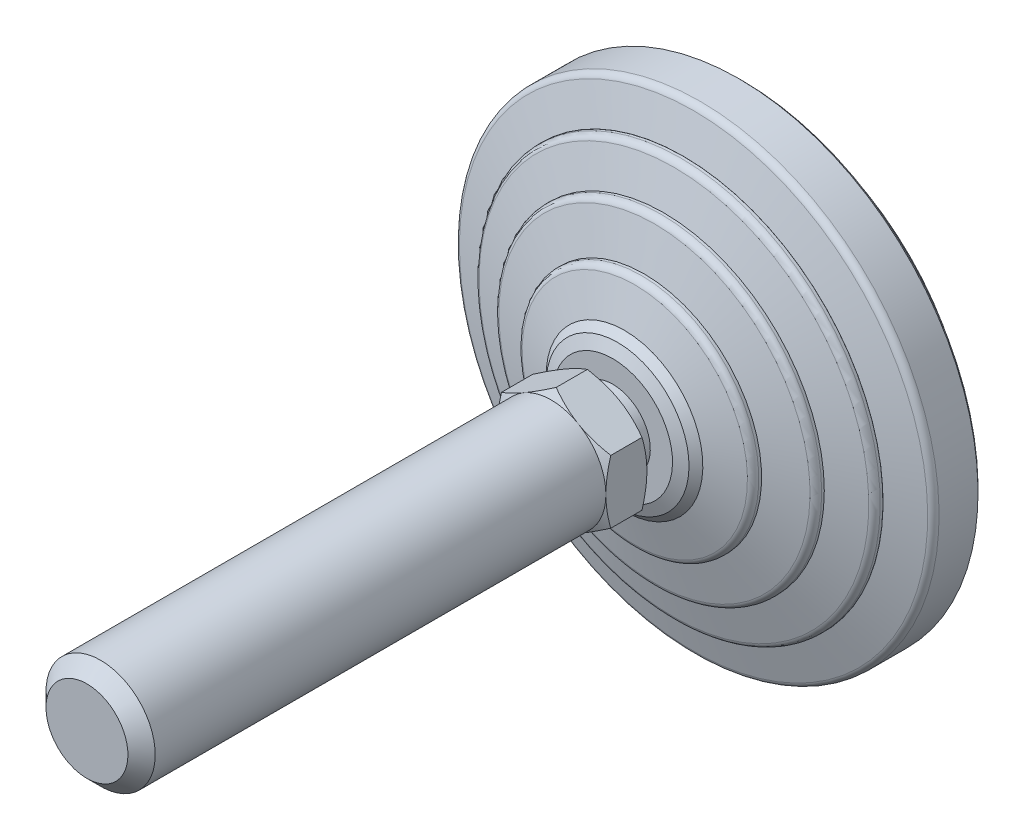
ISO-10303-21;
HEADER;
FILE_DESCRIPTION(('STEP AP214'),'2;1');
FILE_NAME('part.step','',(''),(''),'','','');
FILE_SCHEMA(('AUTOMOTIVE_DESIGN { 1 0 10303 214 1 1 1 1 }'));
ENDSEC;
DATA;
#1=APPLICATION_CONTEXT('core data for automotive mechanical design processes');
#2=APPLICATION_PROTOCOL_DEFINITION('international standard','automotive_design',2000,#1);
#3=PRODUCT_CONTEXT('',#1,'mechanical');
#4=PRODUCT('Part','Part','',(#3));
#5=PRODUCT_RELATED_PRODUCT_CATEGORY('part','',(#4));
#6=PRODUCT_DEFINITION_FORMATION('','',#4);
#7=PRODUCT_DEFINITION_CONTEXT('part definition',#1,'design');
#8=PRODUCT_DEFINITION('design','',#6,#7);
#9=PRODUCT_DEFINITION_SHAPE('','',#8);
#10=(LENGTH_UNIT() NAMED_UNIT(*) SI_UNIT(.MILLI.,.METRE.));
#11=(NAMED_UNIT(*) PLANE_ANGLE_UNIT() SI_UNIT($,.RADIAN.));
#12=(NAMED_UNIT(*) SI_UNIT($,.STERADIAN.) SOLID_ANGLE_UNIT());
#13=UNCERTAINTY_MEASURE_WITH_UNIT(LENGTH_MEASURE(1.E-05),#10,'distance_accuracy_value','');
#14=(GEOMETRIC_REPRESENTATION_CONTEXT(3) GLOBAL_UNCERTAINTY_ASSIGNED_CONTEXT((#13)) GLOBAL_UNIT_ASSIGNED_CONTEXT((#10,
#11,#12)) REPRESENTATION_CONTEXT('',''));
#15=CARTESIAN_POINT('',(0.,0.,0.));
#16=DIRECTION('',(0.,0.,1.));
#17=DIRECTION('',(1.,0.,0.));
#18=AXIS2_PLACEMENT_3D('',#15,#16,#17);
#19=CARTESIAN_POINT('',(-7.76470588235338,0.,24.9999999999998));
#20=DIRECTION('',(0.,0.,1.));
#21=DIRECTION('',(0.,-1.,0.));
#22=AXIS2_PLACEMENT_3D('',#19,#20,#21);
#23=PLANE('',#22);
#24=CARTESIAN_POINT('',(0.,0.,24.9999999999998));
#25=DIRECTION('',(0.,0.,-1.));
#26=DIRECTION('',(0.,1.,0.));
#27=AXIS2_PLACEMENT_3D('',#24,#25,#26);
#28=CIRCLE('',#27,5.50000000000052);
#29=CARTESIAN_POINT('',(0.,5.50000000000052,24.9999999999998));
#30=VERTEX_POINT('',#29);
#31=EDGE_CURVE('E346',#30,#30,#28,.T.);
#32=ORIENTED_EDGE('',*,*,#31,.F.);
#33=EDGE_LOOP('',(#32));
#34=FACE_BOUND('',#33,.T.);
#35=CARTESIAN_POINT('',(0.,0.,24.9999999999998));
#36=DIRECTION('',(0.,0.,-1.));
#37=DIRECTION('',(-1.,0.,0.));
#38=AXIS2_PLACEMENT_3D('',#35,#36,#37);
#39=CIRCLE('',#38,8.00000000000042);
#40=CARTESIAN_POINT('',(4.,6.92820323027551,24.9999999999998));
#41=VERTEX_POINT('',#40);
#42=CARTESIAN_POINT('',(8.,0.,24.9999999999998));
#43=VERTEX_POINT('',#42);
#44=EDGE_CURVE('E505',#41,#43,#39,.T.);
#45=ORIENTED_EDGE('',*,*,#44,.T.);
#46=CARTESIAN_POINT('',(4.,-6.92820323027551,24.9999999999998));
#47=VERTEX_POINT('',#46);
#48=EDGE_CURVE('E140',#43,#47,#39,.T.);
#49=ORIENTED_EDGE('',*,*,#48,.T.);
#50=CARTESIAN_POINT('',(-4.,-6.92820323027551,24.9999999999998));
#51=VERTEX_POINT('',#50);
#52=EDGE_CURVE('E139',#47,#51,#39,.T.);
#53=ORIENTED_EDGE('',*,*,#52,.T.);
#54=CARTESIAN_POINT('',(-8.,0.,24.9999999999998));
#55=VERTEX_POINT('',#54);
#56=EDGE_CURVE('E117',#51,#55,#39,.T.);
#57=ORIENTED_EDGE('',*,*,#56,.T.);
#58=CARTESIAN_POINT('',(-4.,6.92820323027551,24.9999999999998));
#59=VERTEX_POINT('',#58);
#60=EDGE_CURVE('E105',#55,#59,#39,.T.);
#61=ORIENTED_EDGE('',*,*,#60,.T.);
#62=EDGE_CURVE('E34',#59,#41,#39,.T.);
#63=ORIENTED_EDGE('',*,*,#62,.T.);
#64=EDGE_LOOP('',(#45,#49,#53,#57,#61,#63));
#65=FACE_BOUND('',#64,.T.);
#66=ADVANCED_FACE('F14',(#34,#65),#23,.F.);
#67=CARTESIAN_POINT('',(0.,0.,0.));
#68=DIRECTION('',(0.,0.,-1.));
#69=DIRECTION('',(0.,1.,0.));
#70=AXIS2_PLACEMENT_3D('',#67,#68,#69);
#71=CYLINDRICAL_SURFACE('',#70,5.50000000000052);
#72=CARTESIAN_POINT('',(0.,0.,22.));
#73=DIRECTION('',(0.,0.,-1.));
#74=DIRECTION('',(0.,1.,0.));
#75=AXIS2_PLACEMENT_3D('',#72,#73,#74);
#76=CIRCLE('',#75,5.50000000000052);
#77=CARTESIAN_POINT('',(0.,5.50000000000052,22.));
#78=VERTEX_POINT('',#77);
#79=EDGE_CURVE('E351',#78,#78,#76,.T.);
#80=ORIENTED_EDGE('',*,*,#79,.F.);
#81=EDGE_LOOP('',(#80));
#82=FACE_BOUND('',#81,.T.);
#83=ORIENTED_EDGE('',*,*,#31,.T.);
#84=EDGE_LOOP('',(#83));
#85=FACE_BOUND('',#84,.T.);
#86=ADVANCED_FACE('F313',(#82,#85),#71,.T.);
#87=CARTESIAN_POINT('',(-8.7540983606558,0.,22.));
#88=DIRECTION('',(0.,0.,-1.));
#89=DIRECTION('',(0.,1.,0.));
#90=AXIS2_PLACEMENT_3D('',#87,#88,#89);
#91=PLANE('',#90);
#92=CARTESIAN_POINT('',(0.,0.,22.));
#93=DIRECTION('',(0.,0.,-1.));
#94=DIRECTION('',(0.,1.,0.));
#95=AXIS2_PLACEMENT_3D('',#92,#93,#94);
#96=CIRCLE('',#95,8.7540983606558);
#97=CARTESIAN_POINT('',(0.,8.7540983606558,22.));
#98=VERTEX_POINT('',#97);
#99=EDGE_CURVE('E354',#98,#98,#96,.T.);
#100=ORIENTED_EDGE('',*,*,#99,.F.);
#101=EDGE_LOOP('',(#100));
#102=FACE_BOUND('',#101,.T.);
#103=ORIENTED_EDGE('',*,*,#79,.T.);
#104=EDGE_LOOP('',(#103));
#105=FACE_BOUND('',#104,.T.);
#106=ADVANCED_FACE('F309',(#102,#105),#91,.F.);
#107=CARTESIAN_POINT('',(0.,0.,22.));
#108=DIRECTION('',(0.,0.,-1.));
#109=DIRECTION('',(0.,1.,0.));
#110=AXIS2_PLACEMENT_3D('',#107,#108,#109);
#111=CONICAL_SURFACE('',#110,8.7540983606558,1.17809724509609);
#112=CARTESIAN_POINT('',(0.,0.,21.2928932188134));
#113=DIRECTION('',(0.,0.,-1.));
#114=DIRECTION('',(0.,1.,0.));
#115=AXIS2_PLACEMENT_3D('',#112,#113,#114);
#116=CIRCLE('',#115,10.4612051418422);
#117=CARTESIAN_POINT('',(0.,10.4612051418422,21.2928932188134));
#118=VERTEX_POINT('',#117);
#119=EDGE_CURVE('E357',#118,#118,#116,.T.);
#120=ORIENTED_EDGE('',*,*,#119,.F.);
#121=EDGE_LOOP('',(#120));
#122=FACE_BOUND('',#121,.T.);
#123=ORIENTED_EDGE('',*,*,#99,.T.);
#124=EDGE_LOOP('',(#123));
#125=FACE_BOUND('',#124,.T.);
#126=ADVANCED_FACE('F305',(#122,#125),#111,.T.);
#127=CARTESIAN_POINT('',(0.,0.,21.2928932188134));
#128=DIRECTION('',(0.,0.,-1.));
#129=DIRECTION('',(0.,1.,0.));
#130=AXIS2_PLACEMENT_3D('',#127,#128,#129);
#131=CONICAL_SURFACE('',#130,10.4612051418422,0.785398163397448);
#132=CARTESIAN_POINT('',(0.,0.,20.2786885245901));
#133=DIRECTION('',(0.,0.,-1.));
#134=DIRECTION('',(0.,1.,0.));
#135=AXIS2_PLACEMENT_3D('',#132,#133,#134);
#136=CIRCLE('',#135,11.4754098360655);
#137=CARTESIAN_POINT('',(0.,11.4754098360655,20.2786885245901));
#138=VERTEX_POINT('',#137);
#139=EDGE_CURVE('E360',#138,#138,#136,.T.);
#140=ORIENTED_EDGE('',*,*,#139,.F.);
#141=EDGE_LOOP('',(#140));
#142=FACE_BOUND('',#141,.T.);
#143=ORIENTED_EDGE('',*,*,#119,.T.);
#144=EDGE_LOOP('',(#143));
#145=FACE_BOUND('',#144,.T.);
#146=ADVANCED_FACE('F301',(#142,#145),#131,.T.);
#147=CARTESIAN_POINT('',(0.,0.,20.2786885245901));
#148=DIRECTION('',(0.,0.,-1.));
#149=DIRECTION('',(0.,1.,0.));
#150=AXIS2_PLACEMENT_3D('',#147,#148,#149);
#151=CONICAL_SURFACE('',#150,11.4754098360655,1.27933953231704);
#152=CARTESIAN_POINT('',(0.,0.,18.7711726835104));
#153=DIRECTION('',(0.,0.,-1.));
#154=DIRECTION('',(0.,1.,0.));
#155=AXIS2_PLACEMENT_3D('',#152,#153,#154);
#156=CIRCLE('',#155,16.5004626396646);
#157=CARTESIAN_POINT('',(0.,16.5004626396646,18.7711726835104));
#158=VERTEX_POINT('',#157);
#159=EDGE_CURVE('E363',#158,#158,#156,.T.);
#160=ORIENTED_EDGE('',*,*,#159,.F.);
#161=EDGE_LOOP('',(#160));
#162=FACE_BOUND('',#161,.T.);
#163=ORIENTED_EDGE('',*,*,#139,.T.);
#164=EDGE_LOOP('',(#163));
#165=FACE_BOUND('',#164,.T.);
#166=ADVANCED_FACE('F297',(#162,#165),#151,.T.);
#167=CARTESIAN_POINT('',(0.,0.,17.8133463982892));
#168=DIRECTION('',(0.,0.,-1.));
#169=DIRECTION('',(0.,1.,0.));
#170=AXIS2_PLACEMENT_3D('',#167,#168,#169);
#171=TOROIDAL_SURFACE('',#170,16.2131147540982,1.);
#172=CARTESIAN_POINT('',(0.,0.,17.8133463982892));
#173=DIRECTION('',(0.,0.,-1.));
#174=DIRECTION('',(0.,1.,0.));
#175=AXIS2_PLACEMENT_3D('',#172,#173,#174);
#176=CIRCLE('',#175,17.2131147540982);
#177=CARTESIAN_POINT('',(0.,17.2131147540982,17.8133463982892));
#178=VERTEX_POINT('',#177);
#179=EDGE_CURVE('E366',#178,#178,#176,.T.);
#180=ORIENTED_EDGE('',*,*,#179,.F.);
#181=EDGE_LOOP('',(#180));
#182=FACE_BOUND('',#181,.T.);
#183=ORIENTED_EDGE('',*,*,#159,.T.);
#184=EDGE_LOOP('',(#183));
#185=FACE_BOUND('',#184,.T.);
#186=ADVANCED_FACE('F293',(#182,#185),#171,.T.);
#187=CARTESIAN_POINT('',(0.,0.,0.));
#188=DIRECTION('',(0.,0.,-1.));
#189=DIRECTION('',(0.,1.,0.));
#190=AXIS2_PLACEMENT_3D('',#187,#188,#189);
#191=CYLINDRICAL_SURFACE('',#190,17.2131147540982);
#192=CARTESIAN_POINT('',(0.,0.,17.4098360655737));
#193=DIRECTION('',(0.,0.,-1.));
#194=DIRECTION('',(0.,1.,0.));
#195=AXIS2_PLACEMENT_3D('',#192,#193,#194);
#196=CIRCLE('',#195,17.2131147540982);
#197=CARTESIAN_POINT('',(0.,17.2131147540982,17.4098360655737));
#198=VERTEX_POINT('',#197);
#199=EDGE_CURVE('E369',#198,#198,#196,.T.);
#200=ORIENTED_EDGE('',*,*,#199,.F.);
#201=EDGE_LOOP('',(#200));
#202=FACE_BOUND('',#201,.T.);
#203=ORIENTED_EDGE('',*,*,#179,.T.);
#204=EDGE_LOOP('',(#203));
#205=FACE_BOUND('',#204,.T.);
#206=ADVANCED_FACE('F289',(#202,#205),#191,.T.);
#207=CARTESIAN_POINT('',(0.,0.,17.4098360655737));
#208=DIRECTION('',(0.,0.,-1.));
#209=DIRECTION('',(0.,1.,0.));
#210=AXIS2_PLACEMENT_3D('',#207,#208,#209);
#211=CONICAL_SURFACE('',#210,17.2131147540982,1.30454427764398);
#212=CARTESIAN_POINT('',(0.,0.,15.8894925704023));
#213=DIRECTION('',(0.,0.,-1.));
#214=DIRECTION('',(0.,1.,0.));
#215=AXIS2_PLACEMENT_3D('',#212,#213,#214);
#216=CIRCLE('',#215,22.7877075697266);
#217=CARTESIAN_POINT('',(0.,22.7877075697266,15.8894925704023));
#218=VERTEX_POINT('',#217);
#219=EDGE_CURVE('E372',#218,#218,#216,.T.);
#220=ORIENTED_EDGE('',*,*,#219,.F.);
#221=EDGE_LOOP('',(#220));
#222=FACE_BOUND('',#221,.T.);
#223=ORIENTED_EDGE('',*,*,#199,.T.);
#224=EDGE_LOOP('',(#223));
#225=FACE_BOUND('',#224,.T.);
#226=ADVANCED_FACE('F285',(#222,#225),#211,.T.);
#227=CARTESIAN_POINT('',(0.,0.,14.9247287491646));
#228=DIRECTION('',(0.,0.,-1.));
#229=DIRECTION('',(0.,1.,0.));
#230=AXIS2_PLACEMENT_3D('',#227,#228,#229);
#231=TOROIDAL_SURFACE('',#230,22.5245901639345,1.);
#232=CARTESIAN_POINT('',(0.,0.,14.9247287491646));
#233=DIRECTION('',(0.,0.,-1.));
#234=DIRECTION('',(0.,1.,0.));
#235=AXIS2_PLACEMENT_3D('',#232,#233,#234);
#236=CIRCLE('',#235,23.5245901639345);
#237=CARTESIAN_POINT('',(0.,23.5245901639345,14.9247287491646));
#238=VERTEX_POINT('',#237);
#239=EDGE_CURVE('E375',#238,#238,#236,.T.);
#240=ORIENTED_EDGE('',*,*,#239,.F.);
#241=EDGE_LOOP('',(#240));
#242=FACE_BOUND('',#241,.T.);
#243=ORIENTED_EDGE('',*,*,#219,.T.);
#244=EDGE_LOOP('',(#243));
#245=FACE_BOUND('',#244,.T.);
#246=ADVANCED_FACE('F281',(#242,#245),#231,.T.);
#247=CARTESIAN_POINT('',(0.,0.,0.));
#248=DIRECTION('',(0.,0.,-1.));
#249=DIRECTION('',(0.,1.,0.));
#250=AXIS2_PLACEMENT_3D('',#247,#248,#249);
#251=CYLINDRICAL_SURFACE('',#250,23.5245901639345);
#252=CARTESIAN_POINT('',(0.,0.,14.5409836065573));
#253=DIRECTION('',(0.,0.,-1.));
#254=DIRECTION('',(0.,1.,0.));
#255=AXIS2_PLACEMENT_3D('',#252,#253,#254);
#256=CIRCLE('',#255,23.5245901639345);
#257=CARTESIAN_POINT('',(0.,23.5245901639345,14.5409836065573));
#258=VERTEX_POINT('',#257);
#259=EDGE_CURVE('E378',#258,#258,#256,.T.);
#260=ORIENTED_EDGE('',*,*,#259,.F.);
#261=EDGE_LOOP('',(#260));
#262=FACE_BOUND('',#261,.T.);
#263=ORIENTED_EDGE('',*,*,#239,.T.);
#264=EDGE_LOOP('',(#263));
#265=FACE_BOUND('',#264,.T.);
#266=ADVANCED_FACE('F277',(#262,#265),#251,.T.);
#267=CARTESIAN_POINT('',(0.,0.,14.5409836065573));
#268=DIRECTION('',(0.,0.,-1.));
#269=DIRECTION('',(0.,1.,0.));
#270=AXIS2_PLACEMENT_3D('',#267,#268,#269);
#271=CONICAL_SURFACE('',#270,23.5245901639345,1.27871257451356);
#272=CARTESIAN_POINT('',(0.,0.,13.0337743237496));
#273=DIRECTION('',(0.,0.,-1.));
#274=DIRECTION('',(0.,1.,0.));
#275=AXIS2_PLACEMENT_3D('',#272,#273,#274);
#276=CIRCLE('',#275,28.5372004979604);
#277=CARTESIAN_POINT('',(0.,28.5372004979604,13.0337743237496));
#278=VERTEX_POINT('',#277);
#279=EDGE_CURVE('E381',#278,#278,#276,.T.);
#280=ORIENTED_EDGE('',*,*,#279,.F.);
#281=EDGE_LOOP('',(#280));
#282=FACE_BOUND('',#281,.T.);
#283=ORIENTED_EDGE('',*,*,#259,.T.);
#284=EDGE_LOOP('',(#283));
#285=FACE_BOUND('',#284,.T.);
#286=ADVANCED_FACE('F273',(#282,#285),#271,.T.);
#287=CARTESIAN_POINT('',(0.,0.,12.0761283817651));
#288=DIRECTION('',(0.,0.,-1.));
#289=DIRECTION('',(0.,1.,0.));
#290=AXIS2_PLACEMENT_3D('',#287,#288,#289);
#291=TOROIDAL_SURFACE('',#290,28.2492521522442,1.);
#292=CARTESIAN_POINT('',(0.,0.,12.0761283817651));
#293=DIRECTION('',(0.,0.,-1.));
#294=DIRECTION('',(0.,1.,0.));
#295=AXIS2_PLACEMENT_3D('',#292,#293,#294);
#296=CIRCLE('',#295,29.2492521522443);
#297=CARTESIAN_POINT('',(0.,29.2492521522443,12.0761283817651));
#298=VERTEX_POINT('',#297);
#299=EDGE_CURVE('E384',#298,#298,#296,.T.);
#300=ORIENTED_EDGE('',*,*,#299,.F.);
#301=EDGE_LOOP('',(#300));
#302=FACE_BOUND('',#301,.T.);
#303=ORIENTED_EDGE('',*,*,#279,.T.);
#304=EDGE_LOOP('',(#303));
#305=FACE_BOUND('',#304,.T.);
#306=ADVANCED_FACE('F269',(#302,#305),#291,.T.);
#307=CARTESIAN_POINT('',(0.,0.,0.));
#308=DIRECTION('',(0.,0.,-1.));
#309=DIRECTION('',(0.,1.,0.));
#310=AXIS2_PLACEMENT_3D('',#307,#308,#309);
#311=CYLINDRICAL_SURFACE('',#310,29.2492521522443);
#312=CARTESIAN_POINT('',(0.,0.,11.672131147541));
#313=DIRECTION('',(0.,0.,-1.));
#314=DIRECTION('',(0.,1.,0.));
#315=AXIS2_PLACEMENT_3D('',#312,#313,#314);
#316=CIRCLE('',#315,29.2492521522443);
#317=CARTESIAN_POINT('',(0.,29.2492521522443,11.672131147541));
#318=VERTEX_POINT('',#317);
#319=EDGE_CURVE('E387',#318,#318,#316,.T.);
#320=ORIENTED_EDGE('',*,*,#319,.F.);
#321=EDGE_LOOP('',(#320));
#322=FACE_BOUND('',#321,.T.);
#323=ORIENTED_EDGE('',*,*,#299,.T.);
#324=EDGE_LOOP('',(#323));
#325=FACE_BOUND('',#324,.T.);
#326=ADVANCED_FACE('F265',(#322,#325),#311,.T.);
#327=CARTESIAN_POINT('',(-29.2622950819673,0.,11.672131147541));
#328=DIRECTION('',(0.,0.,-1.));
#329=DIRECTION('',(0.,1.,0.));
#330=AXIS2_PLACEMENT_3D('',#327,#328,#329);
#331=PLANE('',#330);
#332=CARTESIAN_POINT('',(0.,0.,11.672131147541));
#333=DIRECTION('',(0.,0.,-1.));
#334=DIRECTION('',(0.,1.,0.));
#335=AXIS2_PLACEMENT_3D('',#332,#333,#334);
#336=CIRCLE('',#335,29.2622950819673);
#337=CARTESIAN_POINT('',(0.,29.2622950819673,11.672131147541));
#338=VERTEX_POINT('',#337);
#339=EDGE_CURVE('E390',#338,#338,#336,.T.);
#340=ORIENTED_EDGE('',*,*,#339,.F.);
#341=EDGE_LOOP('',(#340));
#342=FACE_BOUND('',#341,.T.);
#343=ORIENTED_EDGE('',*,*,#319,.T.);
#344=EDGE_LOOP('',(#343));
#345=FACE_BOUND('',#344,.T.);
#346=ADVANCED_FACE('F261',(#342,#345),#331,.F.);
#347=CARTESIAN_POINT('',(0.,0.,11.672131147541));
#348=DIRECTION('',(0.,0.,-1.));
#349=DIRECTION('',(0.,1.,0.));
#350=AXIS2_PLACEMENT_3D('',#347,#348,#349);
#351=CONICAL_SURFACE('',#350,29.2622950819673,1.27933953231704);
#352=CARTESIAN_POINT('',(0.,0.,10.1646153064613));
#353=DIRECTION('',(0.,0.,-1.));
#354=DIRECTION('',(0.,1.,0.));
#355=AXIS2_PLACEMENT_3D('',#352,#353,#354);
#356=CIRCLE('',#355,34.2873478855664);
#357=CARTESIAN_POINT('',(0.,34.2873478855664,10.1646153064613));
#358=VERTEX_POINT('',#357);
#359=EDGE_CURVE('E393',#358,#358,#356,.T.);
#360=ORIENTED_EDGE('',*,*,#359,.F.);
#361=EDGE_LOOP('',(#360));
#362=FACE_BOUND('',#361,.T.);
#363=ORIENTED_EDGE('',*,*,#339,.T.);
#364=EDGE_LOOP('',(#363));
#365=FACE_BOUND('',#364,.T.);
#366=ADVANCED_FACE('F257',(#362,#365),#351,.T.);
#367=CARTESIAN_POINT('',(0.,0.,9.20678902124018));
#368=DIRECTION('',(0.,0.,-1.));
#369=DIRECTION('',(0.,1.,0.));
#370=AXIS2_PLACEMENT_3D('',#367,#368,#369);
#371=TOROIDAL_SURFACE('',#370,34.,1.);
#372=CARTESIAN_POINT('',(0.,0.,9.20678902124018));
#373=DIRECTION('',(0.,0.,-1.));
#374=DIRECTION('',(0.,1.,0.));
#375=AXIS2_PLACEMENT_3D('',#372,#373,#374);
#376=CIRCLE('',#375,35.);
#377=CARTESIAN_POINT('',(0.,35.,9.20678902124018));
#378=VERTEX_POINT('',#377);
#379=EDGE_CURVE('E396',#378,#378,#376,.T.);
#380=ORIENTED_EDGE('',*,*,#379,.F.);
#381=EDGE_LOOP('',(#380));
#382=FACE_BOUND('',#381,.T.);
#383=ORIENTED_EDGE('',*,*,#359,.T.);
#384=EDGE_LOOP('',(#383));
#385=FACE_BOUND('',#384,.T.);
#386=ADVANCED_FACE('F253',(#382,#385),#371,.T.);
#387=CARTESIAN_POINT('',(0.,0.,0.));
#388=DIRECTION('',(0.,0.,-1.));
#389=DIRECTION('',(0.,1.,0.));
#390=AXIS2_PLACEMENT_3D('',#387,#388,#389);
#391=CYLINDRICAL_SURFACE('',#390,35.);
#392=CARTESIAN_POINT('',(0.,0.,3.5));
#393=DIRECTION('',(0.,0.,-1.));
#394=DIRECTION('',(0.,1.,0.));
#395=AXIS2_PLACEMENT_3D('',#392,#393,#394);
#396=CIRCLE('',#395,35.);
#397=CARTESIAN_POINT('',(0.,35.,3.5));
#398=VERTEX_POINT('',#397);
#399=EDGE_CURVE('E399',#398,#398,#396,.T.);
#400=ORIENTED_EDGE('',*,*,#399,.F.);
#401=EDGE_LOOP('',(#400));
#402=FACE_BOUND('',#401,.T.);
#403=ORIENTED_EDGE('',*,*,#379,.T.);
#404=EDGE_LOOP('',(#403));
#405=FACE_BOUND('',#404,.T.);
#406=ADVANCED_FACE('F249',(#402,#405),#391,.T.);
#407=CARTESIAN_POINT('',(0.,0.,3.5));
#408=DIRECTION('',(0.,0.,1.));
#409=DIRECTION('',(0.,-1.,0.));
#410=AXIS2_PLACEMENT_3D('',#407,#408,#409);
#411=CONICAL_SURFACE('',#410,35.,0.785398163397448);
#412=CARTESIAN_POINT('',(0.,0.,3.));
#413=DIRECTION('',(0.,0.,-1.));
#414=DIRECTION('',(0.,1.,0.));
#415=AXIS2_PLACEMENT_3D('',#412,#413,#414);
#416=CIRCLE('',#415,34.5);
#417=CARTESIAN_POINT('',(0.,34.5,3.));
#418=VERTEX_POINT('',#417);
#419=EDGE_CURVE('E402',#418,#418,#416,.T.);
#420=ORIENTED_EDGE('',*,*,#419,.F.);
#421=EDGE_LOOP('',(#420));
#422=FACE_BOUND('',#421,.T.);
#423=ORIENTED_EDGE('',*,*,#399,.T.);
#424=EDGE_LOOP('',(#423));
#425=FACE_BOUND('',#424,.T.);
#426=ADVANCED_FACE('F245',(#422,#425),#411,.T.);
#427=CARTESIAN_POINT('',(-34.5,0.,3.));
#428=DIRECTION('',(0.,0.,1.));
#429=DIRECTION('',(0.,-1.,0.));
#430=AXIS2_PLACEMENT_3D('',#427,#428,#429);
#431=PLANE('',#430);
#432=CARTESIAN_POINT('',(0.,0.,3.));
#433=DIRECTION('',(0.,0.,-1.));
#434=DIRECTION('',(0.,1.,0.));
#435=AXIS2_PLACEMENT_3D('',#432,#433,#434);
#436=CIRCLE('',#435,30.4098360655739);
#437=CARTESIAN_POINT('',(0.,30.4098360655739,3.));
#438=VERTEX_POINT('',#437);
#439=EDGE_CURVE('E405',#438,#438,#436,.T.);
#440=ORIENTED_EDGE('',*,*,#439,.F.);
#441=EDGE_LOOP('',(#440));
#442=FACE_BOUND('',#441,.T.);
#443=ORIENTED_EDGE('',*,*,#419,.T.);
#444=EDGE_LOOP('',(#443));
#445=FACE_BOUND('',#444,.T.);
#446=ADVANCED_FACE('F241',(#442,#445),#431,.F.);
#447=CARTESIAN_POINT('',(0.,0.,0.));
#448=DIRECTION('',(0.,0.,-1.));
#449=DIRECTION('',(0.,1.,0.));
#450=AXIS2_PLACEMENT_3D('',#447,#448,#449);
#451=CYLINDRICAL_SURFACE('',#450,30.4098360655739);
#452=CARTESIAN_POINT('',(0.,0.,0.));
#453=DIRECTION('',(0.,0.,-1.));
#454=DIRECTION('',(0.,1.,0.));
#455=AXIS2_PLACEMENT_3D('',#452,#453,#454);
#456=CIRCLE('',#455,30.4098360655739);
#457=CARTESIAN_POINT('',(0.,30.4098360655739,0.));
#458=VERTEX_POINT('',#457);
#459=EDGE_CURVE('E408',#458,#458,#456,.T.);
#460=ORIENTED_EDGE('',*,*,#459,.F.);
#461=EDGE_LOOP('',(#460));
#462=FACE_BOUND('',#461,.T.);
#463=ORIENTED_EDGE('',*,*,#439,.T.);
#464=EDGE_LOOP('',(#463));
#465=FACE_BOUND('',#464,.T.);
#466=ADVANCED_FACE('F237',(#462,#465),#451,.T.);
#467=CARTESIAN_POINT('',(-30.4098360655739,0.,0.));
#468=DIRECTION('',(0.,0.,1.));
#469=DIRECTION('',(0.,-1.,0.));
#470=AXIS2_PLACEMENT_3D('',#467,#468,#469);
#471=PLANE('',#470);
#472=ORIENTED_EDGE('',*,*,#459,.T.);
#473=EDGE_LOOP('',(#472));
#474=FACE_BOUND('',#473,.T.);
#475=ADVANCED_FACE('F233',(#474),#471,.F.);
#476=CARTESIAN_POINT('',(0.,0.,26.3497134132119));
#477=DIRECTION('',(0.,0.,1.));
#478=DIRECTION('',(1.,0.,0.));
#479=AXIS2_PLACEMENT_3D('',#476,#477,#478);
#480=CONICAL_SURFACE('',#479,10.3377722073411,1.0471975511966);
#481=CARTESIAN_POINT('',(8.,-12.3380646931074,28.8709532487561));
#482=CARTESIAN_POINT('',(8.,-11.9892260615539,28.702012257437));
#483=CARTESIAN_POINT('',(8.,-11.6395792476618,28.5347111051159));
#484=CARTESIAN_POINT('',(8.,-10.9382391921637,28.2043121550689));
#485=CARTESIAN_POINT('',(8.,-10.586545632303,28.0412150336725));
#486=CARTESIAN_POINT('',(8.,-9.8788367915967,27.7193125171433));
#487=CARTESIAN_POINT('',(8.,-9.52280836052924,27.5605359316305));
#488=CARTESIAN_POINT('',(8.,-8.80789574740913,27.2495726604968));
#489=CARTESIAN_POINT('',(8.,-8.44901170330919,27.0973856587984));
#490=CARTESIAN_POINT('',(8.,-7.71649108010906,26.7966945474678));
#491=CARTESIAN_POINT('',(8.,-7.34274494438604,26.6484558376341));
#492=CARTESIAN_POINT('',(8.,-6.59085569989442,26.363364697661));
#493=CARTESIAN_POINT('',(8.,-6.21271209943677,26.226513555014));
#494=CARTESIAN_POINT('',(8.,-5.45215204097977,25.9678410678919));
#495=CARTESIAN_POINT('',(8.,-5.06974625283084,25.8459886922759));
#496=CARTESIAN_POINT('',(8.,-4.29946389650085,25.6212672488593));
#497=CARTESIAN_POINT('',(8.,-3.91158911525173,25.5183921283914));
#498=CARTESIAN_POINT('',(8.,-3.13222823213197,25.3371589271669));
#499=CARTESIAN_POINT('',(8.,-2.74077336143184,25.2586701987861));
#500=CARTESIAN_POINT('',(8.,-2.15008184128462,25.1626578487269));
#501=CARTESIAN_POINT('',(8.,-1.95258473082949,25.1342725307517));
#502=CARTESIAN_POINT('',(8.,-1.55663236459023,25.0853004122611));
#503=CARTESIAN_POINT('',(8.,-1.35817720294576,25.064712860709));
#504=CARTESIAN_POINT('',(8.,-0.963136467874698,25.032001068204));
#505=CARTESIAN_POINT('',(8.,-0.766559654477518,25.0197714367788));
#506=CARTESIAN_POINT('',(8.,-0.373065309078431,25.0036311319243));
#507=CARTESIAN_POINT('',(8.,-0.176147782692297,24.9997203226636));
#508=CARTESIAN_POINT('',(8.,0.217676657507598,25.0003107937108));
#509=CARTESIAN_POINT('',(8.,0.414583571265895,25.0048121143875));
#510=CARTESIAN_POINT('',(8.,0.808034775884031,25.022118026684));
#511=CARTESIAN_POINT('',(8.,1.00457904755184,25.0349230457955));
#512=CARTESIAN_POINT('',(8.,1.47904634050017,25.0755893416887));
#513=CARTESIAN_POINT('',(8.,1.75662875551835,25.1075076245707));
#514=CARTESIAN_POINT('',(8.,2.30967483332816,25.186149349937));
#515=CARTESIAN_POINT('',(8.,2.58513819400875,25.2328748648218));
#516=CARTESIAN_POINT('',(8.,3.4080684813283,25.3927795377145));
#517=CARTESIAN_POINT('',(8.,3.95175540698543,25.5256558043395));
#518=CARTESIAN_POINT('',(8.,4.7645996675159,25.7553308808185));
#519=CARTESIAN_POINT('',(8.,5.03799210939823,25.8379970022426));
#520=CARTESIAN_POINT('',(8.,5.58212053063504,26.0117306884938));
#521=CARTESIAN_POINT('',(8.,5.85285649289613,26.1027983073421));
#522=CARTESIAN_POINT('',(8.,6.39176049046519,26.2918892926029));
#523=CARTESIAN_POINT('',(8.,6.65992938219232,26.389910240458));
#524=CARTESIAN_POINT('',(8.,7.19405807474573,26.591773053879));
#525=CARTESIAN_POINT('',(8.,7.46001789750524,26.6956148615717));
#526=CARTESIAN_POINT('',(8.,8.07089633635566,26.9406027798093));
#527=CARTESIAN_POINT('',(8.,8.41512812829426,27.0834579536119));
#528=CARTESIAN_POINT('',(8.,9.10079575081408,27.3757450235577));
#529=CARTESIAN_POINT('',(8.,9.44223143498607,27.5251772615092));
#530=CARTESIAN_POINT('',(8.,10.122805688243,27.8293473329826));
#531=CARTESIAN_POINT('',(8.,10.4619437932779,27.984086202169));
#532=CARTESIAN_POINT('',(8.,11.1382255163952,28.2978382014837));
#533=CARTESIAN_POINT('',(8.,11.4753691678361,28.4568512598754));
#534=CARTESIAN_POINT('',(8.,12.1482914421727,28.778525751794));
#535=CARTESIAN_POINT('',(8.,12.484068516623,28.9411904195));
#536=CARTESIAN_POINT('',(8.,13.1542018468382,29.2694230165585));
#537=CARTESIAN_POINT('',(8.,13.4885580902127,29.4349909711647));
#538=CARTESIAN_POINT('',(8.,14.4898392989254,29.9353083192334));
#539=CARTESIAN_POINT('',(8.,15.1549628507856,30.2736645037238));
#540=CARTESIAN_POINT('',(8.,16.1235240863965,30.7726901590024));
#541=CARTESIAN_POINT('',(8.,16.4283588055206,30.9306651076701));
#542=CARTESIAN_POINT('',(8.,17.0373626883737,31.2478811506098));
#543=CARTESIAN_POINT('',(8.,17.3415318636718,31.4071222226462));
#544=CARTESIAN_POINT('',(8.,18.2531970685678,31.886502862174));
#545=CARTESIAN_POINT('',(8.,18.8598277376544,32.2082879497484));
#546=CARTESIAN_POINT('',(8.,20.0698980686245,32.8544750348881));
#547=CARTESIAN_POINT('',(8.,20.6733418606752,33.1788693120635));
#548=CARTESIAN_POINT('',(8.,21.8787565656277,33.8303108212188));
#549=CARTESIAN_POINT('',(8.,22.4807275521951,34.1573579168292));
#550=CARTESIAN_POINT('',(8.,23.0821513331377,34.4854018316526));
#551=B_SPLINE_CURVE_WITH_KNOTS('',3,(#481,#482,#483,#484,#485,#486,#487,#488,#489,#490,#491,
#492,#493,#494,#495,#496,#497,#498,#499,#500,#501,#502,#503,#504,#505,#506,#507,#508,#509,#510,
#511,#512,#513,#514,#515,#516,#517,#518,#519,#520,#521,#522,#523,#524,#525,#526,#527,#528,#529,
#530,#531,#532,#533,#534,#535,#536,#537,#538,#539,#540,#541,#542,#543,#544,#545,#546,#547,#548,
#549,#550),.UNSPECIFIED.,.F.,.F.,(4,2,2,2,2,2,2,2,2,2,2,2,2,2,2,2,2,2,2,2,2,2,2,2,2,2,2,2,2,2,2,
2,2,2,4),(0.,1.1627978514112,2.32578161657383,3.49521360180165,4.66458943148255,
5.87065775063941,7.07686224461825,8.28052769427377,9.48380857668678,10.6805271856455,
11.2789770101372,11.8773691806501,12.4680692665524,13.058759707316,13.6494529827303,
14.2401766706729,15.0779362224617,15.9158130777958,17.5925275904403,18.4493097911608,
19.3060975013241,20.1625886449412,21.0190712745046,22.1370722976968,23.2551314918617,
24.3734101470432,25.4916700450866,26.6109628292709,27.7302653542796,29.9689166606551,
30.998926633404,32.0289185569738,34.0889802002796,36.1443040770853,38.1995229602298),.UNSPECIFIED.);
#552=CARTESIAN_POINT('',(8.,4.61880215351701,25.7145311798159));
#553=VERTEX_POINT('',#552);
#554=EDGE_CURVE('E115',#553,#43,#551,.F.);
#555=ORIENTED_EDGE('',*,*,#554,.T.);
#556=ORIENTED_EDGE('',*,*,#44,.F.);
#557=CARTESIAN_POINT('',(-1.07666623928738,9.85921785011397,26.1072606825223));
#558=CARTESIAN_POINT('',(-0.879957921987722,9.74564825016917,26.0297682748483));
#559=CARTESIAN_POINT('',(-0.682461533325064,9.6316236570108,25.954860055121));
#560=CARTESIAN_POINT('',(-0.285733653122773,9.40257270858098,25.8111416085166));
#561=CARTESIAN_POINT('',(-0.0865015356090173,9.2875459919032,25.7423336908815));
#562=CARTESIAN_POINT('',(0.314542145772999,9.05600331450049,25.6115334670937));
#563=CARTESIAN_POINT('',(0.516360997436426,8.93948314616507,25.5495707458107));
#564=CARTESIAN_POINT('',(0.92175354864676,8.70542964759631,25.4338999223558));
#565=CARTESIAN_POINT('',(1.12532705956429,8.5878964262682,25.3801909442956));
#566=CARTESIAN_POINT('',(1.52784560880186,8.35550223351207,25.2836867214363));
#567=CARTESIAN_POINT('',(1.72673880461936,8.24067119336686,25.2406050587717));
#568=CARTESIAN_POINT('',(2.12593487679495,8.01019523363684,25.1642964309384));
#569=CARTESIAN_POINT('',(2.32623764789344,7.8945503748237,25.1310687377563));
#570=CARTESIAN_POINT('',(2.72759468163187,7.66282678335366,25.0754292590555));
#571=CARTESIAN_POINT('',(2.9286468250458,7.54674927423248,25.0529972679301));
#572=CARTESIAN_POINT('',(3.33146343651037,7.31418299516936,25.0195414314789));
#573=CARTESIAN_POINT('',(3.53322788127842,7.19769423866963,25.0085172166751));
#574=CARTESIAN_POINT('',(3.924901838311,6.97156117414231,24.9985400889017));
#575=CARTESIAN_POINT('',(4.11479842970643,6.86192432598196,24.9989044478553));
#576=CARTESIAN_POINT('',(4.49436233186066,6.64278300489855,25.0100179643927));
#577=CARTESIAN_POINT('',(4.68402964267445,6.53327853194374,25.0207671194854));
#578=CARTESIAN_POINT('',(5.06303459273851,6.31445992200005,25.0523686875));
#579=CARTESIAN_POINT('',(5.25237120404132,6.20514637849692,25.073237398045));
#580=CARTESIAN_POINT('',(5.63006191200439,5.98708654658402,25.1245154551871));
#581=CARTESIAN_POINT('',(5.81841601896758,5.87834025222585,25.1549247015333));
#582=CARTESIAN_POINT('',(6.39270474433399,5.54677450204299,25.2614214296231));
#583=CARTESIAN_POINT('',(6.77664747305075,5.32510506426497,25.3517793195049));
#584=CARTESIAN_POINT('',(7.53721636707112,4.88599040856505,25.5620230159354));
#585=CARTESIAN_POINT('',(7.91386172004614,4.6685341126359,25.6818152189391));
#586=CARTESIAN_POINT('',(8.28701665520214,4.45309301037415,25.8127317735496));
#587=B_SPLINE_CURVE_WITH_KNOTS('',3,(#557,#558,#559,#560,#561,#562,#563,#564,#565,#566,#567,
#568,#569,#570,#571,#572,#573,#574,#575,#576,#577,#578,#579,#580,#581,#582,#583,#584,#585,#586),
.UNSPECIFIED.,.F.,.F.,(4,2,2,2,2,2,2,2,2,2,2,2,2,2,4),(0.,0.720007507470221,1.44028641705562,
2.16356569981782,2.88676817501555,3.58757935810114,4.28833875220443,4.98778143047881,
5.68720145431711,6.34477747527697,7.00235333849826,7.66099176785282,8.31962327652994,
9.67572625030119,11.0275712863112),.UNSPECIFIED.);
#588=EDGE_CURVE('E18',#41,#553,#587,.T.);
#589=ORIENTED_EDGE('',*,*,#588,.T.);
#590=EDGE_LOOP('',(#555,#556,#589));
#591=FACE_BOUND('',#590,.T.);
#592=ADVANCED_FACE('F157',(#591),#480,.T.);
#593=CARTESIAN_POINT('',(-14.4446156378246,0.898001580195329,28.7369010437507));
#594=CARTESIAN_POINT('',(-14.1394833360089,1.07416979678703,28.5674355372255));
#595=CARTESIAN_POINT('',(-13.8336056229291,1.25076837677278,28.3997253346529));
#596=CARTESIAN_POINT('',(-13.2199507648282,1.60506217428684,28.068833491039));
#597=CARTESIAN_POINT('',(-12.9121732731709,1.78275759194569,27.9056527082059));
#598=CARTESIAN_POINT('',(-12.2924946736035,2.14052919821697,27.5839000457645));
#599=CARTESIAN_POINT('',(-11.980579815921,2.3206133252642,27.4253633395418));
#600=CARTESIAN_POINT('',(-11.3540953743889,2.68231428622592,27.1154738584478));
#601=CARTESIAN_POINT('',(-11.0395259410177,2.86393103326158,26.964120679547));
#602=CARTESIAN_POINT('',(-10.4043716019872,3.2306375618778,26.6692307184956));
#603=CARTESIAN_POINT('',(-10.0837580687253,3.41574387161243,26.5257756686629));
#604=CARTESIAN_POINT('',(-9.43864542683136,3.7881998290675,26.2507928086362));
#605=CARTESIAN_POINT('',(-9.11414586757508,3.97554973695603,26.1192663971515));
#606=CARTESIAN_POINT('',(-8.46149422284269,4.35235833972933,25.8719193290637));
#607=CARTESIAN_POINT('',(-8.1333526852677,4.54181094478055,25.7560619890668));
#608=CARTESIAN_POINT('',(-7.47239239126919,4.92341654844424,25.5440407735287));
#609=CARTESIAN_POINT('',(-7.13957526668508,5.11556860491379,25.4478702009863));
#610=CARTESIAN_POINT('',(-6.47205031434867,5.50096431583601,25.2809208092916));
#611=CARTESIAN_POINT('',(-6.13738310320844,5.69418452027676,25.2099315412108));
#612=CARTESIAN_POINT('',(-5.63264316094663,5.98559626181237,25.1252668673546));
#613=CARTESIAN_POINT('',(-5.46391781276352,6.08300988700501,25.1006800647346));
#614=CARTESIAN_POINT('',(-5.12575956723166,6.27824564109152,25.0592668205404));
#615=CARTESIAN_POINT('',(-4.95632673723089,6.37606773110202,25.0424396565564));
#616=CARTESIAN_POINT('',(-4.61793299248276,6.57143945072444,25.0169876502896));
#617=CARTESIAN_POINT('',(-4.44897459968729,6.66898762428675,25.00831824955));
#618=CARTESIAN_POINT('',(-4.11089251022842,6.86417940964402,24.9992191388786));
#619=CARTESIAN_POINT('',(-3.94176881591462,6.96182302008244,24.9987893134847));
#620=CARTESIAN_POINT('',(-3.60369905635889,7.15700768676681,25.0061793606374));
#621=CARTESIAN_POINT('',(-3.43475295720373,7.25454876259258,25.013997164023));
#622=CARTESIAN_POINT('',(-3.0972829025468,7.4493871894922,25.0376974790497));
#623=CARTESIAN_POINT('',(-2.92875897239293,7.54668452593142,25.0535804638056));
#624=CARTESIAN_POINT('',(-2.51266588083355,7.78691598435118,25.1024344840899));
#625=CARTESIAN_POINT('',(-2.26548866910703,7.92962381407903,25.1399366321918));
#626=CARTESIAN_POINT('',(-1.77323151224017,8.21382861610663,25.2301351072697));
#627=CARTESIAN_POINT('',(-1.52815191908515,8.35532538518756,25.282833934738));
#628=CARTESIAN_POINT('',(-0.795550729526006,8.77829287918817,25.4610596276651));
#629=CARTESIAN_POINT('',(-0.31164459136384,9.05767621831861,25.6065868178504));
#630=CARTESIAN_POINT('',(0.411753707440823,9.4753304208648,25.8551634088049));
#631=CARTESIAN_POINT('',(0.655071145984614,9.61580980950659,25.9441941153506));
#632=CARTESIAN_POINT('',(1.13935695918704,9.89541235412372,26.1305512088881));
#633=CARTESIAN_POINT('',(1.38032513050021,10.0345353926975,26.2278783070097));
#634=CARTESIAN_POINT('',(1.85870319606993,10.3107270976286,26.4287878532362));
#635=CARTESIAN_POINT('',(2.09612559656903,10.4478029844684,26.5323309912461));
#636=CARTESIAN_POINT('',(2.56898838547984,10.7208104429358,26.7450355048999));
#637=CARTESIAN_POINT('',(2.80442940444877,10.8567423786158,26.8541950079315));
#638=CARTESIAN_POINT('',(3.03904221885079,10.9921961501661,26.9656278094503));
#639=B_SPLINE_CURVE_WITH_KNOTS('',3,(#593,#594,#595,#596,#597,#598,#599,#600,#601,#602,#603,
#604,#605,#606,#607,#608,#609,#610,#611,#612,#613,#614,#615,#616,#617,#618,#619,#620,#621,#622,
#623,#624,#625,#626,#627,#628,#629,#630,#631,#632,#633,#634,#635,#636,#637,#638),.UNSPECIFIED.,
.F.,.F.,(4,2,2,2,2,2,2,2,2,2,2,2,2,2,2,2,2,2,2,2,2,2,4),(0.,1.17293490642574,2.34609055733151,
3.52657728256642,4.70699753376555,5.89794347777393,7.08902888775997,8.27727566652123,
9.46511755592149,10.6427844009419,11.2317714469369,11.8207036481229,12.4064000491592,
12.9920882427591,13.57762953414,14.1632051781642,15.0263154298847,15.8895677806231,
17.6194669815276,18.5035888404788,19.3877865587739,20.2668852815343,21.1456927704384),.UNSPECIFIED.);
#640=CARTESIAN_POINT('',(0.,9.23760430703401,25.7145311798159));
#641=VERTEX_POINT('',#640);
#642=EDGE_CURVE('E149',#59,#641,#639,.T.);
#643=ORIENTED_EDGE('',*,*,#642,.T.);
#644=EDGE_CURVE('E9',#641,#41,#587,.T.);
#645=ORIENTED_EDGE('',*,*,#644,.T.);
#646=ORIENTED_EDGE('',*,*,#62,.F.);
#647=EDGE_LOOP('',(#643,#645,#646));
#648=FACE_BOUND('',#647,.T.);
#649=ADVANCED_FACE('F498',(#648),#480,.T.);
#650=CARTESIAN_POINT('',(-6.44980682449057,-12.9614020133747,28.7397852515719));
#651=CARTESIAN_POINT('',(-6.14470792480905,-12.7852530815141,28.5703124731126));
#652=CARTESIAN_POINT('',(-5.83886447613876,-12.6086742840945,28.4025927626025));
#653=CARTESIAN_POINT('',(-5.22528052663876,-12.2544214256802,28.0716756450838));
#654=CARTESIAN_POINT('',(-4.91753968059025,-12.0767471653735,27.9084790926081));
#655=CARTESIAN_POINT('',(-4.29794270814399,-11.7190226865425,27.5866893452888));
#656=CARTESIAN_POINT('',(-3.98607288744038,-11.5389645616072,27.4281311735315));
#657=CARTESIAN_POINT('',(-3.35968187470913,-11.1773175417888,27.1181873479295));
#658=CARTESIAN_POINT('',(-3.04516083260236,-10.9957287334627,26.9668012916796));
#659=CARTESIAN_POINT('',(-2.41007261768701,-10.6290603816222,26.6718136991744));
#660=CARTESIAN_POINT('',(-2.08947649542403,-10.4439641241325,26.5282947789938));
#661=CARTESIAN_POINT('',(-1.44440224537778,-10.071530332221,26.2531664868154));
#662=CARTESIAN_POINT('',(-1.11992366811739,-9.88419253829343,26.1215585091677));
#663=CARTESIAN_POINT('',(-0.467314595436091,-9.50740851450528,25.8740248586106));
#664=CARTESIAN_POINT('',(-0.139194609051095,-9.31796835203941,25.758062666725));
#665=CARTESIAN_POINT('',(0.521721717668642,-8.93638813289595,25.5458044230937));
#666=CARTESIAN_POINT('',(0.85451643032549,-8.74424901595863,25.4495016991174));
#667=CARTESIAN_POINT('',(1.52209449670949,-8.35882263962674,25.2822357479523));
#668=CARTESIAN_POINT('',(1.85683854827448,-8.16555807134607,25.2110692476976));
#669=CARTESIAN_POINT('',(2.3617012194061,-7.87407547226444,25.1261332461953));
#670=CARTESIAN_POINT('',(2.53046866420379,-7.77663754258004,25.1014550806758));
#671=CARTESIAN_POINT('',(2.86871405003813,-7.58135147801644,25.0598590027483));
#672=CARTESIAN_POINT('',(3.03819192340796,-7.48350338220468,25.0429403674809));
#673=CARTESIAN_POINT('',(3.37667426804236,-7.28808050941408,25.017308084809));
#674=CARTESIAN_POINT('',(3.54567618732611,-7.19050720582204,25.0085496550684));
#675=CARTESIAN_POINT('',(3.88384856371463,-6.99526329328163,24.9992759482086));
#676=CARTESIAN_POINT('',(4.05301901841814,-6.89759268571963,24.9987605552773));
#677=CARTESIAN_POINT('',(4.39118513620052,-6.70235238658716,25.0059849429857));
#678=CARTESIAN_POINT('',(4.56018083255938,-6.60478267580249,25.0137226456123));
#679=CARTESIAN_POINT('',(4.89775257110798,-6.40988554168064,25.0372698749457));
#680=CARTESIAN_POINT('',(5.0663285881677,-6.3125581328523,25.0530798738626));
#681=CARTESIAN_POINT('',(5.4822916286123,-6.07240175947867,25.1017330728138));
#682=CARTESIAN_POINT('',(5.72928931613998,-5.92979757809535,25.1390945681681));
#683=CARTESIAN_POINT('',(6.22119408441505,-5.64579622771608,25.2290012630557));
#684=CARTESIAN_POINT('',(6.46610081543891,-5.5043992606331,25.2815489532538));
#685=CARTESIAN_POINT('',(7.19819037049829,-5.08172715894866,25.4593138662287));
#686=CARTESIAN_POINT('',(7.68176603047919,-4.80253462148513,25.6045246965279));
#687=CARTESIAN_POINT('',(8.40468482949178,-4.38515725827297,25.8526333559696));
#688=CARTESIAN_POINT('',(8.647849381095,-4.24476613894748,25.9415100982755));
#689=CARTESIAN_POINT('',(9.13183076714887,-3.96533935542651,26.1275629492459));
#690=CARTESIAN_POINT('',(9.37264739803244,-3.82630380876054,26.2247397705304));
#691=CARTESIAN_POINT('',(9.85072468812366,-3.55028575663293,26.4253541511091));
#692=CARTESIAN_POINT('',(10.087997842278,-3.41329603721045,26.5287524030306));
#693=CARTESIAN_POINT('',(10.5605620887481,-3.14046094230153,26.741171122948));
#694=CARTESIAN_POINT('',(10.7958538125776,-3.00461520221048,26.850189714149));
#695=CARTESIAN_POINT('',(11.0303171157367,-2.86924775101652,26.9614835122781));
#696=B_SPLINE_CURVE_WITH_KNOTS('',3,(#650,#651,#652,#653,#654,#655,#656,#657,#658,#659,#660,
#661,#662,#663,#664,#665,#666,#667,#668,#669,#670,#671,#672,#673,#674,#675,#676,#677,#678,#679,
#680,#681,#682,#683,#684,#685,#686,#687,#688,#689,#690,#691,#692,#693,#694,#695),.UNSPECIFIED.,
.F.,.F.,(4,2,2,2,2,2,2,2,2,2,2,2,2,2,2,2,2,2,2,2,2,2,4),(0.,1.1728400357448,2.34590015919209,
3.52627022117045,4.70657397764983,5.89753337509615,7.08863201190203,8.27690053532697,
9.464765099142,10.6427909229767,11.231957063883,11.8210683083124,12.4069271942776,
12.9927778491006,13.5784810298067,14.1642184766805,15.0266578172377,15.8892386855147,
17.6177900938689,18.5012673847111,19.3848206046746,20.2632819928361,21.1414519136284),.UNSPECIFIED.);
#697=CARTESIAN_POINT('',(8.,-4.61880215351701,25.7145311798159));
#698=VERTEX_POINT('',#697);
#699=EDGE_CURVE('E135',#698,#47,#696,.F.);
#700=ORIENTED_EDGE('',*,*,#699,.T.);
#701=ORIENTED_EDGE('',*,*,#48,.F.);
#702=EDGE_CURVE('E150',#43,#698,#551,.F.);
#703=ORIENTED_EDGE('',*,*,#702,.T.);
#704=EDGE_LOOP('',(#700,#701,#703));
#705=FACE_BOUND('',#704,.T.);
#706=ADVANCED_FACE('F492',(#705),#480,.T.);
#707=CARTESIAN_POINT('',(0.293645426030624,-9.40714057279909,25.8150583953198));
#708=CARTESIAN_POINT('',(-0.0796560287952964,-9.19161487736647,25.6839458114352));
#709=CARTESIAN_POINT('',(-0.456448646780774,-8.97407355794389,25.5639465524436));
#710=CARTESIAN_POINT('',(-1.21732409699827,-8.53478191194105,25.3532761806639));
#711=CARTESIAN_POINT('',(-1.60142620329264,-8.31302045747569,25.2626989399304));
#712=CARTESIAN_POINT('',(-2.17595794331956,-7.98131440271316,25.155878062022));
#713=CARTESIAN_POINT('',(-2.36439027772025,-7.87252294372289,25.1253633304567));
#714=CARTESIAN_POINT('',(-2.74224126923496,-7.6543705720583,25.0738769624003));
#715=CARTESIAN_POINT('',(-2.93165993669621,-7.54500965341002,25.0529054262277));
#716=CARTESIAN_POINT('',(-3.31083239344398,-7.32609433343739,25.0211038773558));
#717=CARTESIAN_POINT('',(-3.50058514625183,-7.21654053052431,25.0102575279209));
#718=CARTESIAN_POINT('',(-3.88032383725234,-6.99729829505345,24.9989580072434));
#719=CARTESIAN_POINT('',(-4.07030977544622,-6.88760986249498,24.9985048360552));
#720=CARTESIAN_POINT('',(-4.46195094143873,-6.66149572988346,25.0083044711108));
#721=CARTESIAN_POINT('',(-4.6635937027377,-6.54507722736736,25.0192278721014));
#722=CARTESIAN_POINT('',(-5.06617162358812,-6.31264875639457,25.0524723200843));
#723=CARTESIAN_POINT('',(-5.26710676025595,-6.19663880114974,25.0747937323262));
#724=CARTESIAN_POINT('',(-5.6682336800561,-5.96504806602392,25.1302057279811));
#725=CARTESIAN_POINT('',(-5.86842335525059,-5.8494685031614,25.1633164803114));
#726=CARTESIAN_POINT('',(-6.26739723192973,-5.61912082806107,25.2393883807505));
#727=CARTESIAN_POINT('',(-6.46618132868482,-5.5043527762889,25.2823502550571));
#728=CARTESIAN_POINT('',(-6.8684777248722,-5.2720868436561,25.3786099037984));
#729=CARTESIAN_POINT('',(-7.07193831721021,-5.15461881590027,25.4321939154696));
#730=CARTESIAN_POINT('',(-7.47710757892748,-4.92069423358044,25.5476161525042));
#731=CARTESIAN_POINT('',(-7.67881605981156,-4.80423778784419,25.6094552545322));
#732=CARTESIAN_POINT('',(-8.07964291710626,-4.57282029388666,25.7400119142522));
#733=CARTESIAN_POINT('',(-8.27876855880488,-4.4578550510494,25.8086999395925));
#734=CARTESIAN_POINT('',(-8.67528448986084,-4.22892647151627,25.9521818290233));
#735=CARTESIAN_POINT('',(-8.87267540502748,-4.11496277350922,26.0269733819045));
#736=CARTESIAN_POINT('',(-9.06927841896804,-4.00145397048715,26.1043509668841));
#737=B_SPLINE_CURVE_WITH_KNOTS('',3,(#707,#708,#709,#710,#711,#712,#713,#714,#715,#716,#717,
#718,#719,#720,#721,#722,#723,#724,#725,#726,#727,#728,#729,#730,#731,#732,#733,#734,#735,#736),
.UNSPECIFIED.,.F.,.F.,(4,2,2,2,2,2,2,2,2,2,2,2,2,2,4),(0.,1.3525026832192,2.7092791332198,
3.36822288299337,4.02717355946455,4.68505918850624,5.34294482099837,6.04193002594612,
6.74093763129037,7.4412594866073,8.14163298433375,8.86437057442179,9.58718497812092,
10.3070073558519,11.0265584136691),.UNSPECIFIED.);
#738=CARTESIAN_POINT('',(0.,-9.23760430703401,25.7145311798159));
#739=VERTEX_POINT('',#738);
#740=EDGE_CURVE('E443',#739,#51,#737,.T.);
#741=ORIENTED_EDGE('',*,*,#740,.T.);
#742=ORIENTED_EDGE('',*,*,#52,.F.);
#743=EDGE_CURVE('E128',#47,#739,#696,.F.);
#744=ORIENTED_EDGE('',*,*,#743,.T.);
#745=EDGE_LOOP('',(#741,#742,#744));
#746=FACE_BOUND('',#745,.T.);
#747=ADVANCED_FACE('F486',(#746),#480,.T.);
#748=CARTESIAN_POINT('',(-8.,-4.618802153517,25.7145311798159));
#749=VERTEX_POINT('',#748);
#750=EDGE_CURVE('E124',#51,#749,#737,.T.);
#751=ORIENTED_EDGE('',*,*,#750,.T.);
#752=CARTESIAN_POINT('',(-8.,-12.3380646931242,28.8709532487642));
#753=CARTESIAN_POINT('',(-8.,-11.9892260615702,28.7020122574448));
#754=CARTESIAN_POINT('',(-8.,-11.6395792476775,28.5347111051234));
#755=CARTESIAN_POINT('',(-8.,-10.9382391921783,28.2043121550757));
#756=CARTESIAN_POINT('',(-8.,-10.586545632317,28.0412150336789));
#757=CARTESIAN_POINT('',(-8.,-9.87883679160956,27.7193125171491));
#758=CARTESIAN_POINT('',(-8.,-9.52280836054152,27.5605359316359));
#759=CARTESIAN_POINT('',(-8.,-8.80789574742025,27.2495726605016));
#760=CARTESIAN_POINT('',(-8.,-8.44901170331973,27.0973856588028));
#761=CARTESIAN_POINT('',(-8.,-7.7164910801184,26.7966945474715));
#762=CARTESIAN_POINT('',(-8.,-7.34274494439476,26.6484558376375));
#763=CARTESIAN_POINT('',(-8.,-6.59085569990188,26.3633646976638));
#764=CARTESIAN_POINT('',(-8.,-6.2127120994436,26.2265135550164));
#765=CARTESIAN_POINT('',(-8.,-5.45215204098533,25.9678410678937));
#766=CARTESIAN_POINT('',(-8.,-5.06974625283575,25.8459886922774));
#767=CARTESIAN_POINT('',(-8.,-4.29946389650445,25.6212672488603));
#768=CARTESIAN_POINT('',(-8.,-3.91158911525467,25.5183921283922));
#769=CARTESIAN_POINT('',(-8.,-3.13222823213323,25.3371589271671));
#770=CARTESIAN_POINT('',(-8.,-2.74077336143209,25.2586701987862));
#771=CARTESIAN_POINT('',(-8.,-2.15008184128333,25.1626578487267));
#772=CARTESIAN_POINT('',(-8.,-1.95258473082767,25.1342725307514));
#773=CARTESIAN_POINT('',(-8.,-1.55663236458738,25.0853004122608));
#774=CARTESIAN_POINT('',(-8.,-1.35817720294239,25.0647128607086));
#775=CARTESIAN_POINT('',(-8.,-0.963136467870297,25.0320010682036));
#776=CARTESIAN_POINT('',(-8.,-0.766559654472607,25.0197714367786));
#777=CARTESIAN_POINT('',(-8.,-0.373065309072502,25.0036311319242));
#778=CARTESIAN_POINT('',(-8.,-0.17614778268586,24.9997203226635));
#779=CARTESIAN_POINT('',(-8.,0.217676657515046,25.0003107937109));
#780=CARTESIAN_POINT('',(-8.,0.414583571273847,25.0048121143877));
#781=CARTESIAN_POINT('',(-8.,0.808034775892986,25.0221180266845));
#782=CARTESIAN_POINT('',(-8.,1.0045790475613,25.0349230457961));
#783=CARTESIAN_POINT('',(-8.,1.47904634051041,25.0755893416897));
#784=CARTESIAN_POINT('',(-8.,1.75662875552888,25.107507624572));
#785=CARTESIAN_POINT('',(-8.,2.30967483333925,25.1861493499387));
#786=CARTESIAN_POINT('',(-8.,2.5851381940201,25.2328748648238));
#787=CARTESIAN_POINT('',(-8.,3.40806848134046,25.3927795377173));
#788=CARTESIAN_POINT('',(-8.,3.9517554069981,25.5256558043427));
#789=CARTESIAN_POINT('',(-8.,4.76459966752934,25.7553308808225));
#790=CARTESIAN_POINT('',(-8.,5.03799210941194,25.8379970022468));
#791=CARTESIAN_POINT('',(-8.,5.58212053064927,26.0117306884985));
#792=CARTESIAN_POINT('',(-8.,5.85285649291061,26.102798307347));
#793=CARTESIAN_POINT('',(-8.,6.39176049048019,26.2918892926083));
#794=CARTESIAN_POINT('',(-8.,6.65992938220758,26.3899102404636));
#795=CARTESIAN_POINT('',(-8.,7.19405807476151,26.5917730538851));
#796=CARTESIAN_POINT('',(-8.,7.46001789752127,26.695614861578));
#797=CARTESIAN_POINT('',(-8.,8.07089633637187,26.940602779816));
#798=CARTESIAN_POINT('',(-8.,8.41512812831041,27.0834579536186));
#799=CARTESIAN_POINT('',(-8.,9.10079575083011,27.3757450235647));
#800=CARTESIAN_POINT('',(-8.,9.44223143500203,27.5251772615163));
#801=CARTESIAN_POINT('',(-8.,10.1228056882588,27.8293473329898));
#802=CARTESIAN_POINT('',(-8.,10.4619437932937,27.9840862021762));
#803=CARTESIAN_POINT('',(-8.,11.1382255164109,28.297838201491));
#804=CARTESIAN_POINT('',(-8.,11.4753691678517,28.4568512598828));
#805=CARTESIAN_POINT('',(-8.,12.1482914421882,28.7785257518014));
#806=CARTESIAN_POINT('',(-8.,12.4840685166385,28.9411904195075));
#807=CARTESIAN_POINT('',(-8.,13.1542018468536,29.269423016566));
#808=CARTESIAN_POINT('',(-8.,13.4885580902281,29.4349909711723));
#809=CARTESIAN_POINT('',(-8.,14.4898392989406,29.9353083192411));
#810=CARTESIAN_POINT('',(-8.,15.1549628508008,30.2736645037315));
#811=CARTESIAN_POINT('',(-8.,16.1235240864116,30.7726901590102));
#812=CARTESIAN_POINT('',(-8.,16.4283588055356,30.9306651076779));
#813=CARTESIAN_POINT('',(-8.,17.0373626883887,31.2478811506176));
#814=CARTESIAN_POINT('',(-8.,17.3415318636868,31.4071222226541));
#815=CARTESIAN_POINT('',(-8.,18.2531970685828,31.8865028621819));
#816=CARTESIAN_POINT('',(-7.99999999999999,18.8598277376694,32.2082879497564));
#817=CARTESIAN_POINT('',(-7.99999999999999,20.0698980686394,32.8544750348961));
#818=CARTESIAN_POINT('',(-7.99999999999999,20.6733418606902,33.1788693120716));
#819=CARTESIAN_POINT('',(-7.99999999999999,21.8787565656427,33.8303108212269));
#820=CARTESIAN_POINT('',(-8.,22.4807275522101,34.1573579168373));
#821=CARTESIAN_POINT('',(-8.,23.0821513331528,34.4854018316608));
#822=B_SPLINE_CURVE_WITH_KNOTS('',3,(#752,#753,#754,#755,#756,#757,#758,#759,#760,#761,#762,
#763,#764,#765,#766,#767,#768,#769,#770,#771,#772,#773,#774,#775,#776,#777,#778,#779,#780,#781,
#782,#783,#784,#785,#786,#787,#788,#789,#790,#791,#792,#793,#794,#795,#796,#797,#798,#799,#800,
#801,#802,#803,#804,#805,#806,#807,#808,#809,#810,#811,#812,#813,#814,#815,#816,#817,#818,#819,
#820,#821),.UNSPECIFIED.,.F.,.F.,(4,2,2,2,2,2,2,2,2,2,2,2,2,2,2,2,2,2,2,2,2,2,2,2,2,2,2,2,2,2,2,
2,2,2,4),(0.,1.16279785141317,2.32578161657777,3.49521360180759,4.66458943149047,
5.87065775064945,7.0768622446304,8.28052769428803,9.48380857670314,10.680527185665,
11.2789770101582,11.8773691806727,12.4680692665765,13.0587597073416,13.6494529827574,
14.2401766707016,15.0779362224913,15.9158130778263,17.5925275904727,18.4493097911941,
19.3060975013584,20.1625886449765,21.0190712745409,22.1370722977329,23.2551314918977,
24.3734101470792,25.4916700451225,26.6109628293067,27.7302653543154,29.9689166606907,
30.9989266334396,32.0289185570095,34.0889802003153,36.1443040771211,38.1995229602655),.UNSPECIFIED.);
#823=EDGE_CURVE('E120',#749,#55,#822,.T.);
#824=ORIENTED_EDGE('',*,*,#823,.T.);
#825=ORIENTED_EDGE('',*,*,#56,.F.);
#826=EDGE_LOOP('',(#751,#824,#825));
#827=FACE_BOUND('',#826,.T.);
#828=ADVANCED_FACE('F121',(#827),#480,.T.);
#829=CARTESIAN_POINT('',(-8.,4.61880215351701,25.7145311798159));
#830=VERTEX_POINT('',#829);
#831=EDGE_CURVE('E109',#55,#830,#822,.T.);
#832=ORIENTED_EDGE('',*,*,#831,.T.);
#833=EDGE_CURVE('E111',#830,#59,#639,.T.);
#834=ORIENTED_EDGE('',*,*,#833,.T.);
#835=ORIENTED_EDGE('',*,*,#60,.F.);
#836=EDGE_LOOP('',(#832,#834,#835));
#837=FACE_BOUND('',#836,.T.);
#838=ADVANCED_FACE('F107',(#837),#480,.T.);
#839=CARTESIAN_POINT('',(-6.00000000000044,0.,99.));
#840=DIRECTION('',(0.,0.,-1.));
#841=DIRECTION('',(0.,1.,0.));
#842=AXIS2_PLACEMENT_3D('',#839,#840,#841);
#843=PLANE('',#842);
#844=CARTESIAN_POINT('',(0.,0.,99.));
#845=DIRECTION('',(0.,0.,-1.));
#846=DIRECTION('',(0.,1.,0.));
#847=AXIS2_PLACEMENT_3D('',#844,#845,#846);
#848=CIRCLE('',#847,6.00000000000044);
#849=CARTESIAN_POINT('',(0.,6.00000000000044,99.));
#850=VERTEX_POINT('',#849);
#851=EDGE_CURVE('E340',#850,#850,#848,.T.);
#852=ORIENTED_EDGE('',*,*,#851,.F.);
#853=EDGE_LOOP('',(#852));
#854=FACE_BOUND('',#853,.T.);
#855=ADVANCED_FACE('F16',(#854),#843,.F.);
#856=CARTESIAN_POINT('',(0.,0.,99.));
#857=DIRECTION('',(0.,0.,-1.));
#858=DIRECTION('',(0.,1.,0.));
#859=AXIS2_PLACEMENT_3D('',#856,#857,#858);
#860=CONICAL_SURFACE('',#859,6.00000000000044,0.785398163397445);
#861=CARTESIAN_POINT('',(0.,0.,97.));
#862=DIRECTION('',(0.,0.,-1.));
#863=DIRECTION('',(0.,1.,0.));
#864=AXIS2_PLACEMENT_3D('',#861,#862,#863);
#865=CIRCLE('',#864,8.00000000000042);
#866=CARTESIAN_POINT('',(0.,8.00000000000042,97.));
#867=VERTEX_POINT('',#866);
#868=EDGE_CURVE('E337',#867,#867,#865,.T.);
#869=ORIENTED_EDGE('',*,*,#868,.F.);
#870=EDGE_LOOP('',(#869));
#871=FACE_BOUND('',#870,.T.);
#872=ORIENTED_EDGE('',*,*,#851,.T.);
#873=EDGE_LOOP('',(#872));
#874=FACE_BOUND('',#873,.T.);
#875=ADVANCED_FACE('F324',(#871,#874),#860,.T.);
#876=CARTESIAN_POINT('',(0.,0.,0.));
#877=DIRECTION('',(0.,0.,-1.));
#878=DIRECTION('',(0.,1.,0.));
#879=AXIS2_PLACEMENT_3D('',#876,#877,#878);
#880=CYLINDRICAL_SURFACE('',#879,8.00000000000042);
#881=ORIENTED_EDGE('',*,*,#868,.T.);
#882=EDGE_LOOP('',(#881));
#883=FACE_BOUND('',#882,.T.);
#884=CARTESIAN_POINT('',(0.,0.,31.));
#885=DIRECTION('',(0.,0.,-1.));
#886=DIRECTION('',(0.,1.,0.));
#887=AXIS2_PLACEMENT_3D('',#884,#885,#886);
#888=CIRCLE('',#887,8.00000000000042);
#889=CARTESIAN_POINT('',(4.,6.92820323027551,31.));
#890=VERTEX_POINT('',#889);
#891=CARTESIAN_POINT('',(8.00000000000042,0.,31.));
#892=VERTEX_POINT('',#891);
#893=EDGE_CURVE('E345',#890,#892,#888,.T.);
#894=ORIENTED_EDGE('',*,*,#893,.F.);
#895=CARTESIAN_POINT('',(-4.00000000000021,6.92820323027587,31.));
#896=VERTEX_POINT('',#895);
#897=EDGE_CURVE('E341',#896,#890,#888,.T.);
#898=ORIENTED_EDGE('',*,*,#897,.F.);
#899=CARTESIAN_POINT('',(0.,0.,31.));
#900=DIRECTION('',(0.,0.,-1.));
#901=DIRECTION('',(-1.,0.,0.));
#902=AXIS2_PLACEMENT_3D('',#899,#900,#901);
#903=CIRCLE('',#902,8.00000000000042);
#904=CARTESIAN_POINT('',(-8.00000000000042,0.,31.));
#905=VERTEX_POINT('',#904);
#906=EDGE_CURVE('E440',#905,#896,#903,.T.);
#907=ORIENTED_EDGE('',*,*,#906,.F.);
#908=CARTESIAN_POINT('',(-4.00000000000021,-6.92820323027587,31.));
#909=VERTEX_POINT('',#908);
#910=EDGE_CURVE('E344',#909,#905,#888,.T.);
#911=ORIENTED_EDGE('',*,*,#910,.F.);
#912=CARTESIAN_POINT('',(4.00000000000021,-6.92820323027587,31.));
#913=VERTEX_POINT('',#912);
#914=EDGE_CURVE('E437',#913,#909,#888,.T.);
#915=ORIENTED_EDGE('',*,*,#914,.F.);
#916=EDGE_CURVE('E514',#892,#913,#888,.T.);
#917=ORIENTED_EDGE('',*,*,#916,.F.);
#918=EDGE_LOOP('',(#894,#898,#907,#911,#915,#917));
#919=FACE_BOUND('',#918,.T.);
#920=ADVANCED_FACE('F321',(#883,#919),#880,.T.);
#921=CARTESIAN_POINT('',(0.,0.,31.));
#922=DIRECTION('',(0.,0.,-1.));
#923=DIRECTION('',(-1.,0.,0.));
#924=AXIS2_PLACEMENT_3D('',#921,#922,#923);
#925=CONICAL_SURFACE('',#924,8.00000000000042,1.0471975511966);
#926=CARTESIAN_POINT('',(-14.4446156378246,0.898001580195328,27.263098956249));
#927=CARTESIAN_POINT('',(-14.1394833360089,1.07416979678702,27.4325644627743));
#928=CARTESIAN_POINT('',(-13.8336056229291,1.25076837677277,27.6002746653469));
#929=CARTESIAN_POINT('',(-13.2199507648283,1.60506217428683,27.9311665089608));
#930=CARTESIAN_POINT('',(-12.9121732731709,1.78275759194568,28.0943472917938));
#931=CARTESIAN_POINT('',(-12.2924946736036,2.14052919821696,28.4160999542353));
#932=CARTESIAN_POINT('',(-11.9805798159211,2.3206133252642,28.5746366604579));
#933=CARTESIAN_POINT('',(-11.3540953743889,2.68231428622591,28.8845261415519));
#934=CARTESIAN_POINT('',(-11.0395259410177,2.86393103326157,29.0358793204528));
#935=CARTESIAN_POINT('',(-10.4043716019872,3.23063756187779,29.3307692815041));
#936=CARTESIAN_POINT('',(-10.0837580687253,3.41574387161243,29.4742243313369));
#937=CARTESIAN_POINT('',(-9.43864542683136,3.7881998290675,29.7492071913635));
#938=CARTESIAN_POINT('',(-9.11414586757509,3.97554973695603,29.8807336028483));
#939=CARTESIAN_POINT('',(-8.4614942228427,4.35235833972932,30.128080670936));
#940=CARTESIAN_POINT('',(-8.1333526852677,4.54181094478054,30.243938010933));
#941=CARTESIAN_POINT('',(-7.4723923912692,4.92341654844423,30.4559592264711));
#942=CARTESIAN_POINT('',(-7.13957526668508,5.11556860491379,30.5521297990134));
#943=CARTESIAN_POINT('',(-6.47205031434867,5.50096431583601,30.7190791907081));
#944=CARTESIAN_POINT('',(-6.13738310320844,5.69418452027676,30.790068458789));
#945=CARTESIAN_POINT('',(-5.63264316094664,5.98559626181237,30.8747331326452));
#946=CARTESIAN_POINT('',(-5.46391781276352,6.08300988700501,30.8993199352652));
#947=CARTESIAN_POINT('',(-5.12575956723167,6.27824564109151,30.9407331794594));
#948=CARTESIAN_POINT('',(-4.95632673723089,6.37606773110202,30.9575603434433));
#949=CARTESIAN_POINT('',(-4.61793299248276,6.57143945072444,30.9830123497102));
#950=CARTESIAN_POINT('',(-4.44897459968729,6.66898762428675,30.9916817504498));
#951=CARTESIAN_POINT('',(-4.11089251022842,6.86417940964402,31.0007808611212));
#952=CARTESIAN_POINT('',(-3.94176881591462,6.96182302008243,31.001210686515));
#953=CARTESIAN_POINT('',(-3.60369905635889,7.15700768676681,30.9938206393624));
#954=CARTESIAN_POINT('',(-3.43475295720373,7.25454876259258,30.9860028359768));
#955=CARTESIAN_POINT('',(-3.0972829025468,7.4493871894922,30.9623025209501));
#956=CARTESIAN_POINT('',(-2.92875897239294,7.54668452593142,30.9464195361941));
#957=CARTESIAN_POINT('',(-2.51266588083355,7.78691598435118,30.8975655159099));
#958=CARTESIAN_POINT('',(-2.26548866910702,7.92962381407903,30.8600633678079));
#959=CARTESIAN_POINT('',(-1.77323151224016,8.21382861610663,30.76986489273));
#960=CARTESIAN_POINT('',(-1.52815191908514,8.35532538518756,30.7171660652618));
#961=CARTESIAN_POINT('',(-0.795550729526,8.77829287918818,30.5389403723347));
#962=CARTESIAN_POINT('',(-0.311644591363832,9.05767621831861,30.3934131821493));
#963=CARTESIAN_POINT('',(0.411753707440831,9.4753304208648,30.1448365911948));
#964=CARTESIAN_POINT('',(0.655071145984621,9.61580980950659,30.0558058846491));
#965=CARTESIAN_POINT('',(1.13935695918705,9.89541235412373,29.8694487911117));
#966=CARTESIAN_POINT('',(1.38032513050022,10.0345353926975,29.7721216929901));
#967=CARTESIAN_POINT('',(1.85870319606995,10.3107270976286,29.5712121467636));
#968=CARTESIAN_POINT('',(2.09612559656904,10.4478029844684,29.4676690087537));
#969=CARTESIAN_POINT('',(2.56898838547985,10.7208104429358,29.2549644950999));
#970=CARTESIAN_POINT('',(2.80442940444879,10.8567423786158,29.1458049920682));
#971=CARTESIAN_POINT('',(3.03904221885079,10.9921961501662,29.0343721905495));
#972=B_SPLINE_CURVE_WITH_KNOTS('',3,(#926,#927,#928,#929,#930,#931,#932,#933,#934,#935,#936,
#937,#938,#939,#940,#941,#942,#943,#944,#945,#946,#947,#948,#949,#950,#951,#952,#953,#954,#955,
#956,#957,#958,#959,#960,#961,#962,#963,#964,#965,#966,#967,#968,#969,#970,#971),.UNSPECIFIED.,
.F.,.F.,(4,2,2,2,2,2,2,2,2,2,2,2,2,2,2,2,2,2,2,2,2,2,4),(0.,1.17293490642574,2.34609055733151,
3.52657728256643,4.70699753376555,5.89794347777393,7.08902888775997,8.27727566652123,
9.4651175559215,10.6427844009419,11.2317714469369,11.8207036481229,12.4064000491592,
12.9920882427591,13.57762953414,14.1632051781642,15.0263154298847,15.8895677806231,
17.6194669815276,18.5035888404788,19.3877865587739,20.2668852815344,21.1456927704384),.UNSPECIFIED.);
#973=CARTESIAN_POINT('',(-8.,4.61880215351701,30.285468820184));
#974=VERTEX_POINT('',#973);
#975=EDGE_CURVE('E220',#896,#974,#972,.F.);
#976=ORIENTED_EDGE('',*,*,#975,.T.);
#977=CARTESIAN_POINT('',(-8.,-12.3380646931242,27.1290467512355));
#978=CARTESIAN_POINT('',(-8.,-11.9892260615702,27.297987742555));
#979=CARTESIAN_POINT('',(-8.,-11.6395792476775,27.4652888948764));
#980=CARTESIAN_POINT('',(-8.,-10.9382391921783,27.7956878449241));
#981=CARTESIAN_POINT('',(-8.,-10.586545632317,27.9587849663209));
#982=CARTESIAN_POINT('',(-8.,-9.87883679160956,28.2806874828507));
#983=CARTESIAN_POINT('',(-8.,-9.52280836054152,28.4394640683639));
#984=CARTESIAN_POINT('',(-8.,-8.80789574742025,28.7504273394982));
#985=CARTESIAN_POINT('',(-8.,-8.44901170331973,28.902614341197));
#986=CARTESIAN_POINT('',(-8.,-7.7164910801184,29.2033054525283));
#987=CARTESIAN_POINT('',(-8.,-7.34274494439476,29.3515441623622));
#988=CARTESIAN_POINT('',(-8.,-6.59085569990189,29.636635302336));
#989=CARTESIAN_POINT('',(-8.,-6.21271209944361,29.7734864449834));
#990=CARTESIAN_POINT('',(-8.,-5.45215204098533,30.0321589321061));
#991=CARTESIAN_POINT('',(-8.,-5.06974625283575,30.1540113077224));
#992=CARTESIAN_POINT('',(-8.,-4.29946389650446,30.3787327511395));
#993=CARTESIAN_POINT('',(-8.,-3.91158911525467,30.4816078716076));
#994=CARTESIAN_POINT('',(-8.,-3.13222823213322,30.6628410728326));
#995=CARTESIAN_POINT('',(-8.,-2.74077336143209,30.7413298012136));
#996=CARTESIAN_POINT('',(-8.,-2.15008184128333,30.837342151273));
#997=CARTESIAN_POINT('',(-8.,-1.95258473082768,30.8657274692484));
#998=CARTESIAN_POINT('',(-8.,-1.55663236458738,30.9146995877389));
#999=CARTESIAN_POINT('',(-8.,-1.35817720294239,30.9352871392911));
#1000=CARTESIAN_POINT('',(-8.,-0.963136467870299,30.9679989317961));
#1001=CARTESIAN_POINT('',(-8.,-0.766559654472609,30.9802285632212));
#1002=CARTESIAN_POINT('',(-8.,-0.373065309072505,30.9963688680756));
#1003=CARTESIAN_POINT('',(-8.,-0.176147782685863,31.0002796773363));
#1004=CARTESIAN_POINT('',(-8.,0.217676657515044,30.9996892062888));
#1005=CARTESIAN_POINT('',(-8.,0.414583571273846,30.995187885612));
#1006=CARTESIAN_POINT('',(-8.,0.808034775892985,30.9778819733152));
#1007=CARTESIAN_POINT('',(-8.,1.0045790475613,30.9650769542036));
#1008=CARTESIAN_POINT('',(-8.,1.47904634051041,30.92441065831));
#1009=CARTESIAN_POINT('',(-8.,1.75662875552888,30.8924923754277));
#1010=CARTESIAN_POINT('',(-8.,2.30967483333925,30.813850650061));
#1011=CARTESIAN_POINT('',(-8.,2.5851381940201,30.767125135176));
#1012=CARTESIAN_POINT('',(-8.,3.40806848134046,30.6072204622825));
#1013=CARTESIAN_POINT('',(-8.,3.95175540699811,30.4743441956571));
#1014=CARTESIAN_POINT('',(-8.,4.76459966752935,30.2446691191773));
#1015=CARTESIAN_POINT('',(-8.,5.03799210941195,30.1620029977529));
#1016=CARTESIAN_POINT('',(-8.,5.58212053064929,29.9882693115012));
#1017=CARTESIAN_POINT('',(-8.,5.85285649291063,29.8972016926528));
#1018=CARTESIAN_POINT('',(-8.,6.39176049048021,29.7081107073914));
#1019=CARTESIAN_POINT('',(-8.,6.6599293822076,29.6100897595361));
#1020=CARTESIAN_POINT('',(-8.,7.19405807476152,29.4082269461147));
#1021=CARTESIAN_POINT('',(-8.,7.46001789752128,29.3043851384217));
#1022=CARTESIAN_POINT('',(-8.,8.07089633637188,29.0593972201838));
#1023=CARTESIAN_POINT('',(-8.,8.41512812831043,28.9165420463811));
#1024=CARTESIAN_POINT('',(-8.,9.10079575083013,28.6242549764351));
#1025=CARTESIAN_POINT('',(-8.,9.44223143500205,28.4748227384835));
#1026=CARTESIAN_POINT('',(-8.,10.1228056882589,28.17065266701));
#1027=CARTESIAN_POINT('',(-8.,10.4619437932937,28.0159137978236));
#1028=CARTESIAN_POINT('',(-8.,11.1382255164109,27.7021617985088));
#1029=CARTESIAN_POINT('',(-8.,11.4753691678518,27.543148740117));
#1030=CARTESIAN_POINT('',(-8.,12.1482914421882,27.2214742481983));
#1031=CARTESIAN_POINT('',(-8.,12.4840685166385,27.0588095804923));
#1032=CARTESIAN_POINT('',(-8.,13.1542018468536,26.7305769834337));
#1033=CARTESIAN_POINT('',(-8.,13.4885580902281,26.5650090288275));
#1034=CARTESIAN_POINT('',(-8.,14.4898392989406,26.0646916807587));
#1035=CARTESIAN_POINT('',(-8.,15.1549628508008,25.7263354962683));
#1036=CARTESIAN_POINT('',(-8.,16.1235240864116,25.2273098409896));
#1037=CARTESIAN_POINT('',(-8.,16.4283588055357,25.0693348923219));
#1038=CARTESIAN_POINT('',(-8.,17.0373626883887,24.7521188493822));
#1039=CARTESIAN_POINT('',(-8.,17.3415318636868,24.5928777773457));
#1040=CARTESIAN_POINT('',(-8.,18.2531970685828,24.1134971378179));
#1041=CARTESIAN_POINT('',(-7.99999999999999,18.8598277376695,23.7917120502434));
#1042=CARTESIAN_POINT('',(-7.99999999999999,20.0698980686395,23.1455249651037));
#1043=CARTESIAN_POINT('',(-7.99999999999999,20.6733418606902,22.8211306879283));
#1044=CARTESIAN_POINT('',(-7.99999999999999,21.8787565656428,22.1696891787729));
#1045=CARTESIAN_POINT('',(-8.,22.4807275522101,21.8426420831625));
#1046=CARTESIAN_POINT('',(-8.,23.0821513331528,21.514598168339));
#1047=B_SPLINE_CURVE_WITH_KNOTS('',3,(#977,#978,#979,#980,#981,#982,#983,#984,#985,#986,#987,
#988,#989,#990,#991,#992,#993,#994,#995,#996,#997,#998,#999,#1000,#1001,#1002,#1003,#1004,#1005,
#1006,#1007,#1008,#1009,#1010,#1011,#1012,#1013,#1014,#1015,#1016,#1017,#1018,#1019,#1020,#1021,
#1022,#1023,#1024,#1025,#1026,#1027,#1028,#1029,#1030,#1031,#1032,#1033,#1034,#1035,#1036,#1037,
#1038,#1039,#1040,#1041,#1042,#1043,#1044,#1045,#1046),.UNSPECIFIED.,.F.,.F.,(4,2,2,2,2,2,2,2,2,
2,2,2,2,2,2,2,2,2,2,2,2,2,2,2,2,2,2,2,2,2,2,2,2,2,4),(0.,1.16279785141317,2.32578161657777,
3.49521360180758,4.66458943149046,5.87065775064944,7.07686224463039,8.28052769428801,
9.48380857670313,10.680527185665,11.2789770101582,11.8773691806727,12.4680692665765,
13.0587597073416,13.6494529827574,14.2401766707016,15.0779362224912,15.9158130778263,
17.5925275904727,18.4493097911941,19.3060975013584,20.1625886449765,21.0190712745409,
22.1370722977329,23.2551314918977,24.3734101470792,25.4916700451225,26.6109628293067,
27.7302653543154,29.9689166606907,30.9989266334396,32.0289185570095,34.0889802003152,
36.144304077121,38.1995229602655),.UNSPECIFIED.);
#1048=EDGE_CURVE('E218',#974,#905,#1047,.F.);
#1049=ORIENTED_EDGE('',*,*,#1048,.T.);
#1050=ORIENTED_EDGE('',*,*,#906,.T.);
#1051=EDGE_LOOP('',(#976,#1049,#1050));
#1052=FACE_BOUND('',#1051,.T.);
#1053=ADVANCED_FACE('F323',(#1052),#925,.T.);
#1054=CARTESIAN_POINT('',(-8.,-4.61880215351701,30.285468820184));
#1055=VERTEX_POINT('',#1054);
#1056=EDGE_CURVE('E213',#905,#1055,#1047,.F.);
#1057=ORIENTED_EDGE('',*,*,#1056,.T.);
#1058=CARTESIAN_POINT('',(-9.06927841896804,-4.00145397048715,29.8956490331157));
#1059=CARTESIAN_POINT('',(-8.87267540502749,-4.11496277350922,29.9730266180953));
#1060=CARTESIAN_POINT('',(-8.67528448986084,-4.22892647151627,30.0478181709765));
#1061=CARTESIAN_POINT('',(-8.27876855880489,-4.4578550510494,30.1913000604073));
#1062=CARTESIAN_POINT('',(-8.07964291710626,-4.57282029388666,30.2599880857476));
#1063=CARTESIAN_POINT('',(-7.67881605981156,-4.80423778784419,30.3905447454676));
#1064=CARTESIAN_POINT('',(-7.47710757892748,-4.92069423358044,30.4523838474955));
#1065=CARTESIAN_POINT('',(-7.07193831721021,-5.15461881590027,30.5678060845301));
#1066=CARTESIAN_POINT('',(-6.8684777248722,-5.2720868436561,30.6213900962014));
#1067=CARTESIAN_POINT('',(-6.46618132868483,-5.50435277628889,30.7176497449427));
#1068=CARTESIAN_POINT('',(-6.26739723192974,-5.61912082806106,30.7606116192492));
#1069=CARTESIAN_POINT('',(-5.86842335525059,-5.8494685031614,30.8366835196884));
#1070=CARTESIAN_POINT('',(-5.66823368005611,-5.96504806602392,30.8697942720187));
#1071=CARTESIAN_POINT('',(-5.26710676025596,-6.19663880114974,30.9252062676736));
#1072=CARTESIAN_POINT('',(-5.06617162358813,-6.31264875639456,30.9475276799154));
#1073=CARTESIAN_POINT('',(-4.66359370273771,-6.54507722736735,30.9807721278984));
#1074=CARTESIAN_POINT('',(-4.46195094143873,-6.66149572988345,30.9916955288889));
#1075=CARTESIAN_POINT('',(-4.07030977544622,-6.88760986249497,31.0014951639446));
#1076=CARTESIAN_POINT('',(-3.88032383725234,-6.99729829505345,31.0010419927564));
#1077=CARTESIAN_POINT('',(-3.50058514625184,-7.21654053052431,30.9897424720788));
#1078=CARTESIAN_POINT('',(-3.31083239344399,-7.32609433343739,30.978896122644));
#1079=CARTESIAN_POINT('',(-2.93165993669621,-7.54500965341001,30.947094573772));
#1080=CARTESIAN_POINT('',(-2.74224126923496,-7.6543705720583,30.9261230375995));
#1081=CARTESIAN_POINT('',(-2.36439027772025,-7.87252294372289,30.874636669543));
#1082=CARTESIAN_POINT('',(-2.17595794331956,-7.98131440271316,30.8441219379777));
#1083=CARTESIAN_POINT('',(-1.60142620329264,-8.31302045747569,30.7373010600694));
#1084=CARTESIAN_POINT('',(-1.21732409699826,-8.53478191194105,30.6467238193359));
#1085=CARTESIAN_POINT('',(-0.456448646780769,-8.97407355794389,30.4360534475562));
#1086=CARTESIAN_POINT('',(-0.0796560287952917,-9.19161487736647,30.3160541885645));
#1087=CARTESIAN_POINT('',(0.293645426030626,-9.4071405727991,30.18494160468));
#1088=B_SPLINE_CURVE_WITH_KNOTS('',3,(#1058,#1059,#1060,#1061,#1062,#1063,#1064,#1065,#1066,
#1067,#1068,#1069,#1070,#1071,#1072,#1073,#1074,#1075,#1076,#1077,#1078,#1079,#1080,#1081,#1082,
#1083,#1084,#1085,#1086,#1087),.UNSPECIFIED.,.F.,.F.,(4,2,2,2,2,2,2,2,2,2,2,2,2,2,4),(0.,
0.719551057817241,1.43937343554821,2.16218783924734,2.88492542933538,3.58529892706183,
4.28562078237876,4.98462838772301,5.68361359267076,6.3414992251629,6.99938485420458,
7.65833553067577,8.31727928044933,9.67405573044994,11.0265584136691),.UNSPECIFIED.);
#1089=EDGE_CURVE('E219',#1055,#909,#1088,.T.);
#1090=ORIENTED_EDGE('',*,*,#1089,.T.);
#1091=ORIENTED_EDGE('',*,*,#910,.T.);
#1092=EDGE_LOOP('',(#1057,#1090,#1091));
#1093=FACE_BOUND('',#1092,.T.);
#1094=ADVANCED_FACE('F431',(#1093),#925,.T.);
#1095=CARTESIAN_POINT('',(0.,-9.23760430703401,30.285468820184));
#1096=VERTEX_POINT('',#1095);
#1097=EDGE_CURVE('E207',#909,#1096,#1088,.T.);
#1098=ORIENTED_EDGE('',*,*,#1097,.T.);
#1099=CARTESIAN_POINT('',(-6.44980682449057,-12.9614020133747,27.2602147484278));
#1100=CARTESIAN_POINT('',(-6.14470792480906,-12.7852530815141,27.4296875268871));
#1101=CARTESIAN_POINT('',(-5.83886447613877,-12.6086742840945,27.5974072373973));
#1102=CARTESIAN_POINT('',(-5.22528052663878,-12.2544214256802,27.9283243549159));
#1103=CARTESIAN_POINT('',(-4.91753968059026,-12.0767471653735,28.0915209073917));
#1104=CARTESIAN_POINT('',(-4.297942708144,-11.7190226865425,28.413310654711));
#1105=CARTESIAN_POINT('',(-3.98607288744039,-11.5389645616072,28.5718688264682));
#1106=CARTESIAN_POINT('',(-3.35968187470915,-11.1773175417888,28.8818126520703));
#1107=CARTESIAN_POINT('',(-3.04516083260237,-10.9957287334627,29.0331987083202));
#1108=CARTESIAN_POINT('',(-2.41007261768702,-10.6290603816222,29.3281863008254));
#1109=CARTESIAN_POINT('',(-2.08947649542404,-10.4439641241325,29.471705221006));
#1110=CARTESIAN_POINT('',(-1.44440224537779,-10.071530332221,29.7468335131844));
#1111=CARTESIAN_POINT('',(-1.11992366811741,-9.88419253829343,29.8784414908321));
#1112=CARTESIAN_POINT('',(-0.467314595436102,-9.50740851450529,30.1259751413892));
#1113=CARTESIAN_POINT('',(-0.139194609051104,-9.31796835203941,30.2419373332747));
#1114=CARTESIAN_POINT('',(0.521721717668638,-8.93638813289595,30.4541955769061));
#1115=CARTESIAN_POINT('',(0.854516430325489,-8.74424901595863,30.5504983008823));
#1116=CARTESIAN_POINT('',(1.5220944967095,-8.35882263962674,30.7177642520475));
#1117=CARTESIAN_POINT('',(1.85683854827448,-8.16555807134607,30.7889307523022));
#1118=CARTESIAN_POINT('',(2.3617012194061,-7.87407547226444,30.8738667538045));
#1119=CARTESIAN_POINT('',(2.53046866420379,-7.77663754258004,30.898544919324));
#1120=CARTESIAN_POINT('',(2.86871405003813,-7.58135147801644,30.9401409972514));
#1121=CARTESIAN_POINT('',(3.03819192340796,-7.48350338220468,30.9570596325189));
#1122=CARTESIAN_POINT('',(3.37667426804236,-7.28808050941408,30.9826919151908));
#1123=CARTESIAN_POINT('',(3.54567618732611,-7.19050720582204,30.9914503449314));
#1124=CARTESIAN_POINT('',(3.88384856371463,-6.99526329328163,31.0007240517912));
#1125=CARTESIAN_POINT('',(4.05301901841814,-6.89759268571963,31.0012394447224));
#1126=CARTESIAN_POINT('',(4.39118513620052,-6.70235238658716,30.9940150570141));
#1127=CARTESIAN_POINT('',(4.56018083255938,-6.60478267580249,30.9862773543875));
#1128=CARTESIAN_POINT('',(4.89775257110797,-6.40988554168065,30.9627301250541));
#1129=CARTESIAN_POINT('',(5.0663285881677,-6.3125581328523,30.9469201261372));
#1130=CARTESIAN_POINT('',(5.4822916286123,-6.07240175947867,30.8982669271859));
#1131=CARTESIAN_POINT('',(5.72928931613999,-5.92979757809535,30.8609054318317));
#1132=CARTESIAN_POINT('',(6.22119408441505,-5.64579622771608,30.7709987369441));
#1133=CARTESIAN_POINT('',(6.46610081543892,-5.5043992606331,30.718451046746));
#1134=CARTESIAN_POINT('',(7.1981903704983,-5.08172715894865,30.540686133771));
#1135=CARTESIAN_POINT('',(7.6817660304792,-4.80253462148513,30.3954753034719));
#1136=CARTESIAN_POINT('',(8.40468482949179,-4.38515725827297,30.1473666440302));
#1137=CARTESIAN_POINT('',(8.64784938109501,-4.24476613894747,30.0584899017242));
#1138=CARTESIAN_POINT('',(9.13183076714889,-3.9653393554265,29.8724370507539));
#1139=CARTESIAN_POINT('',(9.37264739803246,-3.82630380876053,29.7752602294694));
#1140=CARTESIAN_POINT('',(9.85072468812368,-3.55028575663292,29.5746458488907));
#1141=CARTESIAN_POINT('',(10.087997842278,-3.41329603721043,29.4712475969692));
#1142=CARTESIAN_POINT('',(10.5605620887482,-3.14046094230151,29.2588288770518));
#1143=CARTESIAN_POINT('',(10.7958538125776,-3.00461520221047,29.1498102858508));
#1144=CARTESIAN_POINT('',(11.0303171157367,-2.86924775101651,29.0385164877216));
#1145=B_SPLINE_CURVE_WITH_KNOTS('',3,(#1099,#1100,#1101,#1102,#1103,#1104,#1105,#1106,#1107,
#1108,#1109,#1110,#1111,#1112,#1113,#1114,#1115,#1116,#1117,#1118,#1119,#1120,#1121,#1122,#1123,
#1124,#1125,#1126,#1127,#1128,#1129,#1130,#1131,#1132,#1133,#1134,#1135,#1136,#1137,#1138,#1139,
#1140,#1141,#1142,#1143,#1144),.UNSPECIFIED.,.F.,.F.,(4,2,2,2,2,2,2,2,2,2,2,2,2,2,2,2,2,2,2,2,2,
2,4),(0.,1.1728400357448,2.3459001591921,3.52627022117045,4.70657397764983,5.89753337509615,
7.08863201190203,8.27690053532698,9.46476509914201,10.6427909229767,11.2319570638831,
11.8210683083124,12.4069271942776,12.9927778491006,13.5784810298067,14.1642184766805,
15.0266578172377,15.8892386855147,17.6177900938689,18.5012673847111,19.3848206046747,
20.2632819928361,21.1414519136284),.UNSPECIFIED.);
#1146=EDGE_CURVE('E480',#1096,#913,#1145,.T.);
#1147=ORIENTED_EDGE('',*,*,#1146,.T.);
#1148=ORIENTED_EDGE('',*,*,#914,.T.);
#1149=EDGE_LOOP('',(#1098,#1147,#1148));
#1150=FACE_BOUND('',#1149,.T.);
#1151=ADVANCED_FACE('F483',(#1150),#925,.T.);
#1152=CARTESIAN_POINT('',(8.,-4.61880215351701,30.285468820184));
#1153=VERTEX_POINT('',#1152);
#1154=EDGE_CURVE('E187',#913,#1153,#1145,.T.);
#1155=ORIENTED_EDGE('',*,*,#1154,.T.);
#1156=CARTESIAN_POINT('',(8.,-12.3380646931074,27.1290467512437));
#1157=CARTESIAN_POINT('',(8.,-11.9892260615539,27.2979877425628));
#1158=CARTESIAN_POINT('',(8.,-11.6395792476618,27.4652888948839));
#1159=CARTESIAN_POINT('',(8.,-10.9382391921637,27.7956878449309));
#1160=CARTESIAN_POINT('',(8.,-10.586545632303,27.9587849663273));
#1161=CARTESIAN_POINT('',(8.,-9.8788367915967,28.2806874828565));
#1162=CARTESIAN_POINT('',(8.,-9.52280836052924,28.4394640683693));
#1163=CARTESIAN_POINT('',(8.,-8.80789574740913,28.7504273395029));
#1164=CARTESIAN_POINT('',(8.,-8.44901170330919,28.9026143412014));
#1165=CARTESIAN_POINT('',(8.,-7.71649108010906,29.203305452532));
#1166=CARTESIAN_POINT('',(8.,-7.34274494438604,29.3515441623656));
#1167=CARTESIAN_POINT('',(8.,-6.59085569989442,29.6366353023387));
#1168=CARTESIAN_POINT('',(8.,-6.21271209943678,29.7734864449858));
#1169=CARTESIAN_POINT('',(8.,-5.45215204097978,30.0321589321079));
#1170=CARTESIAN_POINT('',(8.,-5.06974625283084,30.1540113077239));
#1171=CARTESIAN_POINT('',(8.,-4.29946389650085,30.3787327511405));
#1172=CARTESIAN_POINT('',(8.,-3.91158911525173,30.4816078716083));
#1173=CARTESIAN_POINT('',(8.,-3.13222823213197,30.6628410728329));
#1174=CARTESIAN_POINT('',(8.,-2.74077336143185,30.7413298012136));
#1175=CARTESIAN_POINT('',(8.,-2.15008184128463,30.8373421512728));
#1176=CARTESIAN_POINT('',(8.,-1.95258473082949,30.8657274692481));
#1177=CARTESIAN_POINT('',(8.,-1.55663236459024,30.9146995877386));
#1178=CARTESIAN_POINT('',(8.,-1.35817720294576,30.9352871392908));
#1179=CARTESIAN_POINT('',(8.,-0.963136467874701,30.9679989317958));
#1180=CARTESIAN_POINT('',(8.,-0.76655965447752,30.9802285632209));
#1181=CARTESIAN_POINT('',(8.,-0.373065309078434,30.9963688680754));
#1182=CARTESIAN_POINT('',(8.,-0.1761477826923,31.0002796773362));
#1183=CARTESIAN_POINT('',(8.,0.217676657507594,30.9996892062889));
#1184=CARTESIAN_POINT('',(8.,0.414583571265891,30.9951878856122));
#1185=CARTESIAN_POINT('',(8.,0.808034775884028,30.9778819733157));
#1186=CARTESIAN_POINT('',(8.,1.00457904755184,30.9650769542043));
#1187=CARTESIAN_POINT('',(8.,1.47904634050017,30.9244106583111));
#1188=CARTESIAN_POINT('',(8.,1.75662875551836,30.892492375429));
#1189=CARTESIAN_POINT('',(8.,2.30967483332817,30.8138506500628));
#1190=CARTESIAN_POINT('',(8.,2.58513819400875,30.767125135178));
#1191=CARTESIAN_POINT('',(8.,3.40806848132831,30.6072204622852));
#1192=CARTESIAN_POINT('',(8.,3.95175540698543,30.4743441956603));
#1193=CARTESIAN_POINT('',(8.,4.76459966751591,30.2446691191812));
#1194=CARTESIAN_POINT('',(8.,5.03799210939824,30.1620029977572));
#1195=CARTESIAN_POINT('',(8.,5.58212053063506,29.988269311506));
#1196=CARTESIAN_POINT('',(8.,5.85285649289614,29.8972016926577));
#1197=CARTESIAN_POINT('',(8.,6.3917604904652,29.7081107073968));
#1198=CARTESIAN_POINT('',(8.,6.65992938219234,29.6100897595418));
#1199=CARTESIAN_POINT('',(8.,7.19405807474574,29.4082269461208));
#1200=CARTESIAN_POINT('',(8.,7.46001789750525,29.304385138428));
#1201=CARTESIAN_POINT('',(8.,8.07089633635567,29.0593972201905));
#1202=CARTESIAN_POINT('',(8.,8.41512812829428,28.9165420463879));
#1203=CARTESIAN_POINT('',(8.,9.10079575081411,28.624254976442));
#1204=CARTESIAN_POINT('',(8.,9.44223143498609,28.4748227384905));
#1205=CARTESIAN_POINT('',(8.,10.122805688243,28.1706526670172));
#1206=CARTESIAN_POINT('',(8.,10.4619437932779,28.0159137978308));
#1207=CARTESIAN_POINT('',(8.,11.1382255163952,27.7021617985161));
#1208=CARTESIAN_POINT('',(8.,11.4753691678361,27.5431487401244));
#1209=CARTESIAN_POINT('',(8.,12.1482914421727,27.2214742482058));
#1210=CARTESIAN_POINT('',(8.,12.484068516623,27.0588095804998));
#1211=CARTESIAN_POINT('',(8.,13.1542018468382,26.7305769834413));
#1212=CARTESIAN_POINT('',(8.,13.4885580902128,26.5650090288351));
#1213=CARTESIAN_POINT('',(8.,14.4898392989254,26.0646916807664));
#1214=CARTESIAN_POINT('',(8.,15.1549628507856,25.726335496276));
#1215=CARTESIAN_POINT('',(8.,16.1235240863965,25.2273098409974));
#1216=CARTESIAN_POINT('',(8.,16.4283588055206,25.0693348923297));
#1217=CARTESIAN_POINT('',(8.,17.0373626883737,24.75211884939));
#1218=CARTESIAN_POINT('',(8.,17.3415318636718,24.5928777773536));
#1219=CARTESIAN_POINT('',(8.,18.2531970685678,24.1134971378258));
#1220=CARTESIAN_POINT('',(8.,18.8598277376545,23.7917120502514));
#1221=CARTESIAN_POINT('',(8.,20.0698980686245,23.1455249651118));
#1222=CARTESIAN_POINT('',(8.,20.6733418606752,22.8211306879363));
#1223=CARTESIAN_POINT('',(8.,21.8787565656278,22.1696891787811));
#1224=CARTESIAN_POINT('',(8.,22.4807275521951,21.8426420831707));
#1225=CARTESIAN_POINT('',(8.,23.0821513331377,21.5145981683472));
#1226=B_SPLINE_CURVE_WITH_KNOTS('',3,(#1156,#1157,#1158,#1159,#1160,#1161,#1162,#1163,#1164,
#1165,#1166,#1167,#1168,#1169,#1170,#1171,#1172,#1173,#1174,#1175,#1176,#1177,#1178,#1179,#1180,
#1181,#1182,#1183,#1184,#1185,#1186,#1187,#1188,#1189,#1190,#1191,#1192,#1193,#1194,#1195,#1196,
#1197,#1198,#1199,#1200,#1201,#1202,#1203,#1204,#1205,#1206,#1207,#1208,#1209,#1210,#1211,#1212,
#1213,#1214,#1215,#1216,#1217,#1218,#1219,#1220,#1221,#1222,#1223,#1224,#1225),.UNSPECIFIED.,
.F.,.F.,(4,2,2,2,2,2,2,2,2,2,2,2,2,2,2,2,2,2,2,2,2,2,2,2,2,2,2,2,2,2,2,2,2,2,4),(0.,
1.1627978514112,2.32578161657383,3.49521360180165,4.66458943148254,5.8706577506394,
7.07686224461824,8.28052769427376,9.48380857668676,10.6805271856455,11.2789770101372,
11.8773691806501,12.4680692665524,13.0587597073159,13.6494529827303,14.2401766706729,
15.0779362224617,15.9158130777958,17.5925275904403,18.4493097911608,19.3060975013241,
20.1625886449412,21.0190712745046,22.1370722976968,23.2551314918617,24.3734101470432,
25.4916700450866,26.6109628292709,27.7302653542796,29.9689166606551,30.998926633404,
32.0289185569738,34.0889802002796,36.1443040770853,38.1995229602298),.UNSPECIFIED.);
#1227=EDGE_CURVE('E179',#1153,#892,#1226,.T.);
#1228=ORIENTED_EDGE('',*,*,#1227,.T.);
#1229=ORIENTED_EDGE('',*,*,#916,.T.);
#1230=EDGE_LOOP('',(#1155,#1228,#1229));
#1231=FACE_BOUND('',#1230,.T.);
#1232=ADVANCED_FACE('F198',(#1231),#925,.T.);
#1233=CARTESIAN_POINT('',(8.,4.61880215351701,30.285468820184));
#1234=VERTEX_POINT('',#1233);
#1235=EDGE_CURVE('E172',#892,#1234,#1226,.T.);
#1236=ORIENTED_EDGE('',*,*,#1235,.T.);
#1237=CARTESIAN_POINT('',(8.28701665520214,4.45309301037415,30.1872682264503));
#1238=CARTESIAN_POINT('',(7.91386172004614,4.66853411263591,30.3181847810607));
#1239=CARTESIAN_POINT('',(7.53721636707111,4.88599040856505,30.4379769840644));
#1240=CARTESIAN_POINT('',(6.77664747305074,5.32510506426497,30.6482206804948));
#1241=CARTESIAN_POINT('',(6.39270474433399,5.54677450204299,30.7385785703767));
#1242=CARTESIAN_POINT('',(5.81841601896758,5.87834025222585,30.8450752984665));
#1243=CARTESIAN_POINT('',(5.63006191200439,5.98708654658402,30.8754845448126));
#1244=CARTESIAN_POINT('',(5.25237120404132,6.20514637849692,30.9267626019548));
#1245=CARTESIAN_POINT('',(5.06303459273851,6.31445992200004,30.9476313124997));
#1246=CARTESIAN_POINT('',(4.68402964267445,6.53327853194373,30.9792328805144));
#1247=CARTESIAN_POINT('',(4.49436233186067,6.64278300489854,30.9899820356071));
#1248=CARTESIAN_POINT('',(4.11479842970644,6.86192432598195,31.0010955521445));
#1249=CARTESIAN_POINT('',(3.924901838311,6.9715611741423,31.0014599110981));
#1250=CARTESIAN_POINT('',(3.53322788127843,7.19769423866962,30.9914827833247));
#1251=CARTESIAN_POINT('',(3.33146343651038,7.31418299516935,30.9804585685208));
#1252=CARTESIAN_POINT('',(2.9286468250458,7.54674927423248,30.9470027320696));
#1253=CARTESIAN_POINT('',(2.72759468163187,7.66282678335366,30.9245707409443));
#1254=CARTESIAN_POINT('',(2.32623764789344,7.89455037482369,30.8689312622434));
#1255=CARTESIAN_POINT('',(2.12593487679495,8.01019523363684,30.8357035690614));
#1256=CARTESIAN_POINT('',(1.72673880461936,8.24067119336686,30.7593949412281));
#1257=CARTESIAN_POINT('',(1.52784560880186,8.35550223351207,30.7163132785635));
#1258=CARTESIAN_POINT('',(1.12532705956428,8.5878964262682,30.6198090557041));
#1259=CARTESIAN_POINT('',(0.921753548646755,8.70542964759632,30.566100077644));
#1260=CARTESIAN_POINT('',(0.516360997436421,8.93948314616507,30.4504292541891));
#1261=CARTESIAN_POINT('',(0.314542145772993,9.05600331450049,30.3884665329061));
#1262=CARTESIAN_POINT('',(-0.0865015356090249,9.2875459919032,30.2576663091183));
#1263=CARTESIAN_POINT('',(-0.285733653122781,9.40257270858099,30.1888583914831));
#1264=CARTESIAN_POINT('',(-0.682461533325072,9.63162365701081,30.0451399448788));
#1265=CARTESIAN_POINT('',(-0.87995792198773,9.74564825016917,29.9702317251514));
#1266=CARTESIAN_POINT('',(-1.07666623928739,9.85921785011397,29.8927393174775));
#1267=B_SPLINE_CURVE_WITH_KNOTS('',3,(#1237,#1238,#1239,#1240,#1241,#1242,#1243,#1244,#1245,
#1246,#1247,#1248,#1249,#1250,#1251,#1252,#1253,#1254,#1255,#1256,#1257,#1258,#1259,#1260,#1261,
#1262,#1263,#1264,#1265,#1266),.UNSPECIFIED.,.F.,.F.,(4,2,2,2,2,2,2,2,2,2,2,2,2,2,4),(0.,
1.35184503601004,2.70794800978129,3.3665795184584,4.02521794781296,4.68279381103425,
5.3403698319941,6.03978985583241,6.73923253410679,7.43999192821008,8.14080311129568,
8.86400558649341,9.58728486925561,10.307563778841,11.0275712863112),.UNSPECIFIED.);
#1268=EDGE_CURVE('E180',#1234,#890,#1267,.T.);
#1269=ORIENTED_EDGE('',*,*,#1268,.T.);
#1270=ORIENTED_EDGE('',*,*,#893,.T.);
#1271=EDGE_LOOP('',(#1236,#1269,#1270));
#1272=FACE_BOUND('',#1271,.T.);
#1273=ADVANCED_FACE('F193',(#1272),#925,.T.);
#1274=CARTESIAN_POINT('',(0.,9.23760430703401,30.285468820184));
#1275=VERTEX_POINT('',#1274);
#1276=EDGE_CURVE('E226',#1275,#896,#972,.F.);
#1277=ORIENTED_EDGE('',*,*,#1276,.T.);
#1278=ORIENTED_EDGE('',*,*,#897,.T.);
#1279=EDGE_CURVE('E181',#890,#1275,#1267,.T.);
#1280=ORIENTED_EDGE('',*,*,#1279,.T.);
#1281=EDGE_LOOP('',(#1277,#1278,#1280));
#1282=FACE_BOUND('',#1281,.T.);
#1283=ADVANCED_FACE('F197',(#1282),#925,.T.);
#1284=CARTESIAN_POINT('',(0.,9.23760430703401,31.));
#1285=DIRECTION('',(0.5,0.866025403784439,0.));
#1286=DIRECTION('',(-0.866025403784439,0.5,0.));
#1287=AXIS2_PLACEMENT_3D('',#1284,#1285,#1286);
#1288=PLANE('',#1287);
#1289=ORIENTED_EDGE('',*,*,#644,.F.);
#1290=DIRECTION('',(0.,0.,-1.));
#1291=VECTOR('',#1290,1.);
#1292=CARTESIAN_POINT('',(0.,9.23760430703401,31.));
#1293=LINE('',#1292,#1291);
#1294=EDGE_CURVE('E411',#1275,#641,#1293,.T.);
#1295=ORIENTED_EDGE('',*,*,#1294,.F.);
#1296=ORIENTED_EDGE('',*,*,#1279,.F.);
#1297=ORIENTED_EDGE('',*,*,#1268,.F.);
#1298=DIRECTION('',(0.,0.,-1.));
#1299=VECTOR('',#1298,1.);
#1300=CARTESIAN_POINT('',(8.,4.61880215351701,31.));
#1301=LINE('',#1300,#1299);
#1302=EDGE_CURVE('E414',#1234,#553,#1301,.T.);
#1303=ORIENTED_EDGE('',*,*,#1302,.T.);
#1304=ORIENTED_EDGE('',*,*,#588,.F.);
#1305=EDGE_LOOP('',(#1289,#1295,#1296,#1297,#1303,#1304));
#1306=FACE_BOUND('',#1305,.T.);
#1307=ADVANCED_FACE('F165',(#1306),#1288,.T.);
#1308=CARTESIAN_POINT('',(8.,4.61880215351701,31.));
#1309=DIRECTION('',(1.,0.,0.));
#1310=DIRECTION('',(0.,1.,0.));
#1311=AXIS2_PLACEMENT_3D('',#1308,#1309,#1310);
#1312=PLANE('',#1311);
#1313=ORIENTED_EDGE('',*,*,#554,.F.);
#1314=ORIENTED_EDGE('',*,*,#1302,.F.);
#1315=ORIENTED_EDGE('',*,*,#1235,.F.);
#1316=ORIENTED_EDGE('',*,*,#1227,.F.);
#1317=DIRECTION('',(0.,0.,-1.));
#1318=VECTOR('',#1317,1.);
#1319=CARTESIAN_POINT('',(8.,-4.61880215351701,31.));
#1320=LINE('',#1319,#1318);
#1321=EDGE_CURVE('E417',#1153,#698,#1320,.T.);
#1322=ORIENTED_EDGE('',*,*,#1321,.T.);
#1323=ORIENTED_EDGE('',*,*,#702,.F.);
#1324=EDGE_LOOP('',(#1313,#1314,#1315,#1316,#1322,#1323));
#1325=FACE_BOUND('',#1324,.T.);
#1326=ADVANCED_FACE('F160',(#1325),#1312,.T.);
#1327=CARTESIAN_POINT('',(8.,-4.61880215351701,31.));
#1328=DIRECTION('',(0.5,-0.866025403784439,0.));
#1329=DIRECTION('',(0.866025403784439,0.5,0.));
#1330=AXIS2_PLACEMENT_3D('',#1327,#1328,#1329);
#1331=PLANE('',#1330);
#1332=ORIENTED_EDGE('',*,*,#699,.F.);
#1333=ORIENTED_EDGE('',*,*,#1321,.F.);
#1334=ORIENTED_EDGE('',*,*,#1154,.F.);
#1335=ORIENTED_EDGE('',*,*,#1146,.F.);
#1336=DIRECTION('',(0.,0.,-1.));
#1337=VECTOR('',#1336,1.);
#1338=CARTESIAN_POINT('',(0.,-9.23760430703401,31.));
#1339=LINE('',#1338,#1337);
#1340=EDGE_CURVE('E420',#1096,#739,#1339,.T.);
#1341=ORIENTED_EDGE('',*,*,#1340,.T.);
#1342=ORIENTED_EDGE('',*,*,#743,.F.);
#1343=EDGE_LOOP('',(#1332,#1333,#1334,#1335,#1341,#1342));
#1344=FACE_BOUND('',#1343,.T.);
#1345=ADVANCED_FACE('F164',(#1344),#1331,.T.);
#1346=CARTESIAN_POINT('',(0.,-9.23760430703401,31.));
#1347=DIRECTION('',(-0.5,-0.866025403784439,0.));
#1348=DIRECTION('',(0.866025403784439,-0.5,0.));
#1349=AXIS2_PLACEMENT_3D('',#1346,#1347,#1348);
#1350=PLANE('',#1349);
#1351=ORIENTED_EDGE('',*,*,#740,.F.);
#1352=ORIENTED_EDGE('',*,*,#1340,.F.);
#1353=ORIENTED_EDGE('',*,*,#1097,.F.);
#1354=ORIENTED_EDGE('',*,*,#1089,.F.);
#1355=DIRECTION('',(0.,0.,-1.));
#1356=VECTOR('',#1355,1.);
#1357=CARTESIAN_POINT('',(-8.,-4.618802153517,31.));
#1358=LINE('',#1357,#1356);
#1359=EDGE_CURVE('E422',#1055,#749,#1358,.T.);
#1360=ORIENTED_EDGE('',*,*,#1359,.T.);
#1361=ORIENTED_EDGE('',*,*,#750,.F.);
#1362=EDGE_LOOP('',(#1351,#1352,#1353,#1354,#1360,#1361));
#1363=FACE_BOUND('',#1362,.T.);
#1364=ADVANCED_FACE('F426',(#1363),#1350,.T.);
#1365=CARTESIAN_POINT('',(-8.,-4.618802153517,31.));
#1366=DIRECTION('',(-1.,0.,0.));
#1367=DIRECTION('',(0.,-1.,0.));
#1368=AXIS2_PLACEMENT_3D('',#1365,#1366,#1367);
#1369=PLANE('',#1368);
#1370=ORIENTED_EDGE('',*,*,#823,.F.);
#1371=ORIENTED_EDGE('',*,*,#1359,.F.);
#1372=ORIENTED_EDGE('',*,*,#1056,.F.);
#1373=ORIENTED_EDGE('',*,*,#1048,.F.);
#1374=DIRECTION('',(0.,0.,-1.));
#1375=VECTOR('',#1374,1.);
#1376=CARTESIAN_POINT('',(-8.,4.61880215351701,31.));
#1377=LINE('',#1376,#1375);
#1378=EDGE_CURVE('E134',#974,#830,#1377,.T.);
#1379=ORIENTED_EDGE('',*,*,#1378,.T.);
#1380=ORIENTED_EDGE('',*,*,#831,.F.);
#1381=EDGE_LOOP('',(#1370,#1371,#1372,#1373,#1379,#1380));
#1382=FACE_BOUND('',#1381,.T.);
#1383=ADVANCED_FACE('F131',(#1382),#1369,.T.);
#1384=CARTESIAN_POINT('',(-8.,4.61880215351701,31.));
#1385=DIRECTION('',(-0.5,0.866025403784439,0.));
#1386=DIRECTION('',(-0.866025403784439,-0.5,0.));
#1387=AXIS2_PLACEMENT_3D('',#1384,#1385,#1386);
#1388=PLANE('',#1387);
#1389=ORIENTED_EDGE('',*,*,#833,.F.);
#1390=ORIENTED_EDGE('',*,*,#1378,.F.);
#1391=ORIENTED_EDGE('',*,*,#975,.F.);
#1392=ORIENTED_EDGE('',*,*,#1276,.F.);
#1393=ORIENTED_EDGE('',*,*,#1294,.T.);
#1394=ORIENTED_EDGE('',*,*,#642,.F.);
#1395=EDGE_LOOP('',(#1389,#1390,#1391,#1392,#1393,#1394));
#1396=FACE_BOUND('',#1395,.T.);
#1397=ADVANCED_FACE('F228',(#1396),#1388,.T.);
#1398=CLOSED_SHELL('',(#66,#86,#106,#126,#146,#166,#186,#206,#226,#246,#266,#286,#306,#326,#346,
#366,#386,#406,#426,#446,#466,#475,#592,#649,#706,#747,#828,#838,#855,#875,#920,#1053,#1094,
#1151,#1232,#1273,#1283,#1307,#1326,#1345,#1364,#1383,#1397));
#1399=MANIFOLD_SOLID_BREP('B1',#1398);
#1400=ADVANCED_BREP_SHAPE_REPRESENTATION('',(#18,#1399),#14);
#1401=SHAPE_DEFINITION_REPRESENTATION(#9,#1400);
ENDSEC;
END-ISO-10303-21;
